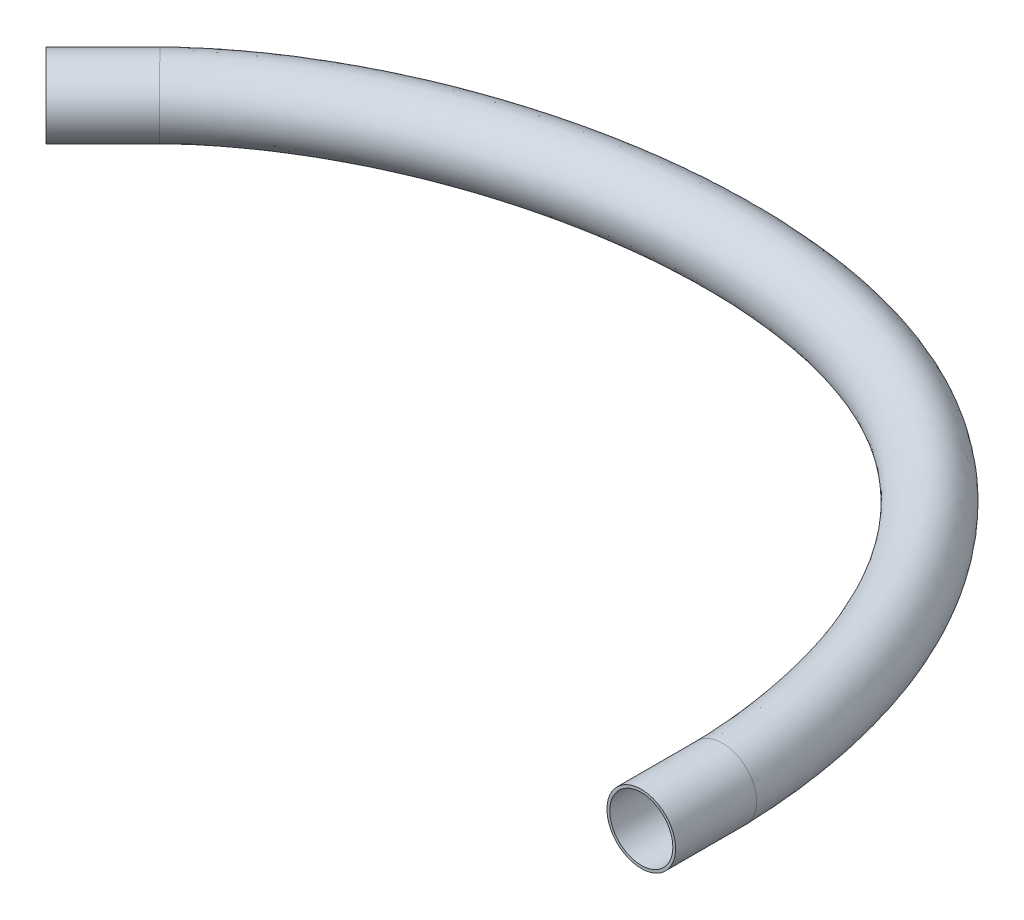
ISO-10303-21;
HEADER;
FILE_DESCRIPTION(('STEP AP214'),'2;1');
FILE_NAME('part.step','',(''),(''),'','','');
FILE_SCHEMA(('AUTOMOTIVE_DESIGN { 1 0 10303 214 1 1 1 1 }'));
ENDSEC;
DATA;
#1=APPLICATION_CONTEXT('core data for automotive mechanical design processes');
#2=APPLICATION_PROTOCOL_DEFINITION('international standard','automotive_design',2000,#1);
#3=PRODUCT_CONTEXT('',#1,'mechanical');
#4=PRODUCT('Part','Part','',(#3));
#5=PRODUCT_RELATED_PRODUCT_CATEGORY('part','',(#4));
#6=PRODUCT_DEFINITION_FORMATION('','',#4);
#7=PRODUCT_DEFINITION_CONTEXT('part definition',#1,'design');
#8=PRODUCT_DEFINITION('design','',#6,#7);
#9=PRODUCT_DEFINITION_SHAPE('','',#8);
#10=(LENGTH_UNIT() NAMED_UNIT(*) SI_UNIT(.MILLI.,.METRE.));
#11=(NAMED_UNIT(*) PLANE_ANGLE_UNIT() SI_UNIT($,.RADIAN.));
#12=(NAMED_UNIT(*) SI_UNIT($,.STERADIAN.) SOLID_ANGLE_UNIT());
#13=UNCERTAINTY_MEASURE_WITH_UNIT(LENGTH_MEASURE(1.E-05),#10,'distance_accuracy_value','');
#14=(GEOMETRIC_REPRESENTATION_CONTEXT(3) GLOBAL_UNCERTAINTY_ASSIGNED_CONTEXT((#13)) GLOBAL_UNIT_ASSIGNED_CONTEXT((#10,
#11,#12)) REPRESENTATION_CONTEXT('',''));
#15=CARTESIAN_POINT('',(0.,0.,0.));
#16=DIRECTION('',(0.,0.,1.));
#17=DIRECTION('',(1.,0.,0.));
#18=AXIS2_PLACEMENT_3D('',#15,#16,#17);
#19=CARTESIAN_POINT('',(-554.764913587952,0.,-250.235086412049));
#20=DIRECTION('',(-0.707106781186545,0.,0.70710678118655));
#21=DIRECTION('',(0.70710678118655,0.,0.707106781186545));
#22=AXIS2_PLACEMENT_3D('',#19,#20,#21);
#23=CYLINDRICAL_SURFACE('',#22,21.75);
#24=CARTESIAN_POINT('',(-554.999999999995,21.75,-250.000000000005));
#25=CARTESIAN_POINT('',(-555.049383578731,21.7500006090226,-250.05035269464));
#26=CARTESIAN_POINT('',(-555.098770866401,21.7496574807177,-250.100709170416));
#27=CARTESIAN_POINT('',(-555.575503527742,21.7430293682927,-250.586797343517));
#28=CARTESIAN_POINT('',(-556.00290408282,21.711367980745,-251.022585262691));
#29=CARTESIAN_POINT('',(-556.641378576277,21.6254809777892,-251.673589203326));
#30=CARTESIAN_POINT('',(-556.853848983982,21.5904314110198,-251.890229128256));
#31=CARTESIAN_POINT('',(-557.277623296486,21.5075808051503,-252.322319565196));
#32=CARTESIAN_POINT('',(-557.488926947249,21.4597770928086,-252.537769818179));
#33=CARTESIAN_POINT('',(-558.121388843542,21.2971088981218,-253.18264305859));
#34=CARTESIAN_POINT('',(-558.540204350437,21.1631076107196,-253.60967730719));
#35=CARTESIAN_POINT('',(-559.368431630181,20.8451069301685,-254.454157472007));
#36=CARTESIAN_POINT('',(-559.777843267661,20.6611068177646,-254.871603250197));
#37=CARTESIAN_POINT('',(-560.382437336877,20.3487657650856,-255.488061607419));
#38=CARTESIAN_POINT('',(-560.582310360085,20.2386420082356,-255.691856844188));
#39=CARTESIAN_POINT('',(-560.97857512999,20.0064881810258,-256.095897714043));
#40=CARTESIAN_POINT('',(-561.1749677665,19.8844612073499,-256.296144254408));
#41=CARTESIAN_POINT('',(-561.758527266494,19.5007568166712,-256.891155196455));
#42=CARTESIAN_POINT('',(-562.140096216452,19.2214453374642,-257.280211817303));
#43=CARTESIAN_POINT('',(-562.885095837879,18.6181287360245,-258.039830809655));
#44=CARTESIAN_POINT('',(-563.248538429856,18.2941535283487,-258.410405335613));
#45=CARTESIAN_POINT('',(-563.955037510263,17.6036345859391,-259.130768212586));
#46=CARTESIAN_POINT('',(-564.298094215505,17.2370913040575,-259.480556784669));
#47=CARTESIAN_POINT('',(-564.96145062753,16.4639539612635,-260.156930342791));
#48=CARTESIAN_POINT('',(-565.281744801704,16.057350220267,-260.483509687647));
#49=CARTESIAN_POINT('',(-565.897213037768,15.207052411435,-261.111055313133));
#50=CARTESIAN_POINT('',(-566.192387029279,14.7633582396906,-261.412021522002));
#51=CARTESIAN_POINT('',(-566.755550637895,13.8419750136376,-261.986236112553));
#52=CARTESIAN_POINT('',(-567.02353670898,13.3642815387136,-262.259480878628));
#53=CARTESIAN_POINT('',(-567.530374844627,12.3783475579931,-262.776264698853));
#54=CARTESIAN_POINT('',(-567.769226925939,11.8701070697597,-263.01980377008));
#55=CARTESIAN_POINT('',(-568.216075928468,10.8267450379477,-263.475421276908));
#56=CARTESIAN_POINT('',(-568.424075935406,10.2916261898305,-263.687502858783));
#57=CARTESIAN_POINT('',(-568.80777018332,9.19826495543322,-264.078726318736));
#58=CARTESIAN_POINT('',(-568.983464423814,8.64002256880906,-264.257868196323));
#59=CARTESIAN_POINT('',(-569.301294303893,7.50439510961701,-264.581934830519));
#60=CARTESIAN_POINT('',(-569.443430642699,6.92701043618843,-264.72686030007));
#61=CARTESIAN_POINT('',(-569.693138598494,5.75719240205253,-264.981468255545));
#62=CARTESIAN_POINT('',(-569.800710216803,5.16475904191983,-265.091150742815));
#63=CARTESIAN_POINT('',(-569.980520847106,3.96907471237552,-265.274489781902));
#64=CARTESIAN_POINT('',(-570.052760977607,3.36582408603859,-265.348147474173));
#65=CARTESIAN_POINT('',(-570.161399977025,2.15277583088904,-265.458918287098));
#66=CARTESIAN_POINT('',(-570.197798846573,1.54297820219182,-265.496031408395));
#67=CARTESIAN_POINT('',(-570.23449648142,0.321170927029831,-265.533449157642));
#68=CARTESIAN_POINT('',(-570.234795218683,-0.29083872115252,-265.533753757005));
#69=CARTESIAN_POINT('',(-570.199290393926,-1.51271834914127,-265.497552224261));
#70=CARTESIAN_POINT('',(-570.163486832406,-2.12258832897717,-265.461046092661));
#71=CARTESIAN_POINT('',(-570.056033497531,-3.3358361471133,-265.351484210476));
#72=CARTESIAN_POINT('',(-569.984384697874,-3.93921416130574,-265.278429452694));
#73=CARTESIAN_POINT('',(-569.805750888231,-5.13520534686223,-265.096290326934));
#74=CARTESIAN_POINT('',(-569.698765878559,-5.72781851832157,-264.987205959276));
#75=CARTESIAN_POINT('',(-569.450218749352,-6.8980749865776,-264.733781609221));
#76=CARTESIAN_POINT('',(-569.308656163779,-7.47571808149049,-264.58944115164));
#77=CARTESIAN_POINT('',(-568.991961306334,-8.61191956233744,-264.266531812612));
#78=CARTESIAN_POINT('',(-568.816829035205,-9.17047794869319,-264.087962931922));
#79=CARTESIAN_POINT('',(-568.434230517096,-10.2645668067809,-263.697856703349));
#80=CARTESIAN_POINT('',(-568.226762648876,-10.8000961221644,-263.486317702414));
#81=CARTESIAN_POINT('',(-567.780974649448,-11.8442899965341,-263.03178201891));
#82=CARTESIAN_POINT('',(-567.54265450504,-12.3529545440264,-262.788785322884));
#83=CARTESIAN_POINT('',(-567.036879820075,-13.3397570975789,-262.273085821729));
#84=CARTESIAN_POINT('',(-566.769427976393,-13.8178979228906,-262.000385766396));
#85=CARTESIAN_POINT('',(-566.207275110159,-14.7403041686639,-261.42720175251));
#86=CARTESIAN_POINT('',(-565.912574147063,-15.1845696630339,-261.126717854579));
#87=CARTESIAN_POINT('',(-565.29804823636,-16.0360235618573,-260.500133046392));
#88=CARTESIAN_POINT('',(-564.978226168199,-16.4432162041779,-260.174035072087));
#89=CARTESIAN_POINT('',(-564.315715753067,-17.2176794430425,-259.498524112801));
#90=CARTESIAN_POINT('',(-563.973027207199,-17.584949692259,-259.149110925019));
#91=CARTESIAN_POINT('',(-563.266982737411,-18.2771732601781,-258.429211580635));
#92=CARTESIAN_POINT('',(-562.903616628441,-18.6021054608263,-258.058715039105));
#93=CARTESIAN_POINT('',(-562.345288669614,-19.0557509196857,-257.489430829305));
#94=CARTESIAN_POINT('',(-562.156960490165,-19.2013443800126,-257.297407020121));
#95=CARTESIAN_POINT('',(-561.776124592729,-19.4811030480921,-256.909097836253));
#96=CARTESIAN_POINT('',(-561.583615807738,-19.6152652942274,-256.712811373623));
#97=CARTESIAN_POINT('',(-561.000148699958,-20.0003372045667,-256.117894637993));
#98=CARTESIAN_POINT('',(-560.603429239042,-20.2336861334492,-255.713390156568));
#99=CARTESIAN_POINT('',(-559.797625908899,-20.6517559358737,-254.891774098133));
#100=CARTESIAN_POINT('',(-559.388542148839,-20.8364772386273,-254.474662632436));
#101=CARTESIAN_POINT('',(-558.768274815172,-21.0759597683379,-253.842223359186));
#102=CARTESIAN_POINT('',(-558.560569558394,-21.1494798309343,-253.630442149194));
#103=CARTESIAN_POINT('',(-558.143229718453,-21.2839463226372,-253.204912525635));
#104=CARTESIAN_POINT('',(-557.933595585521,-21.3448956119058,-252.991164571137));
#105=CARTESIAN_POINT('',(-557.302444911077,-21.5086838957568,-252.34762828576));
#106=CARTESIAN_POINT('',(-556.878404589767,-21.5925696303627,-251.915266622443));
#107=CARTESIAN_POINT('',(-556.235893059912,-21.6805067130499,-251.260146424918));
#108=CARTESIAN_POINT('',(-556.018582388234,-21.7035350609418,-251.03857123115));
#109=CARTESIAN_POINT('',(-555.583574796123,-21.7362502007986,-250.59502699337));
#110=CARTESIAN_POINT('',(-555.365878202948,-21.7459453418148,-250.373058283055));
#111=CARTESIAN_POINT('',(-555.098772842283,-21.7496571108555,-250.100711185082));
#112=CARTESIAN_POINT('',(-555.049385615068,-21.7500002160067,-250.050354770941));
#113=CARTESIAN_POINT('',(-554.999999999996,-21.75,-250.000000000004));
#114=B_SPLINE_CURVE_WITH_KNOTS('',3,(#24,#25,#26,#27,#28,#29,#30,#31,#32,#33,#34,#35,#36,#37,
#38,#39,#40,#41,#42,#43,#44,#45,#46,#47,#48,#49,#50,#51,#52,#53,#54,#55,#56,#57,#58,#59,#60,#61,
#62,#63,#64,#65,#66,#67,#68,#69,#70,#71,#72,#73,#74,#75,#76,#77,#78,#79,#80,#81,#82,#83,#84,#85,
#86,#87,#88,#89,#90,#91,#92,#93,#94,#95,#96,#97,#98,#99,#100,#101,#102,#103,#104,#105,#106,#107,
#108,#109,#110,#111,#112,#113),.UNSPECIFIED.,.F.,.F.,(4,2,2,2,2,2,2,2,2,2,2,2,2,2,2,2,2,2,2,2,2,
2,2,2,2,2,2,2,2,2,2,2,2,2,2,2,2,2,2,2,2,2,2,2,4),(0.,0.211596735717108,2.04250028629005,
2.95867520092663,3.87504229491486,5.71160982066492,7.54820376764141,8.46583220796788,
9.38322255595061,11.2179101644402,13.0513748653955,14.8848200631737,16.7187093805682,
18.5526038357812,20.3867371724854,22.220869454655,24.05481816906,25.8887669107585,
27.7226774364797,29.5565878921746,31.3904402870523,33.2242926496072,35.058146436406,
36.8920001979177,38.7258041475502,40.5596080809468,42.3934367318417,44.2272653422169,
46.0611859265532,47.8951072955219,49.7288590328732,51.5626067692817,53.3961446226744,
55.2296984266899,57.0641633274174,57.9814496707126,58.8989729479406,60.7349019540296,
62.5708147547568,63.487404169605,64.4037848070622,66.2353270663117,67.1687397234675,
68.1015676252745,68.313164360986),.UNSPECIFIED.);
#115=CARTESIAN_POINT('',(-554.999999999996,-21.75,-250.000000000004));
#116=VERTEX_POINT('',#115);
#117=CARTESIAN_POINT('',(-554.999999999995,21.75,-250.000000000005));
#118=VERTEX_POINT('',#117);
#119=EDGE_CURVE('E78',#116,#118,#114,.F.);
#120=ORIENTED_EDGE('',*,*,#119,.F.);
#121=CARTESIAN_POINT('',(-554.999999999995,21.75,-250.000000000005));
#122=CARTESIAN_POINT('',(-554.950616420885,21.7500006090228,-249.949647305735));
#123=CARTESIAN_POINT('',(-554.901229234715,21.7496574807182,-249.899290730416));
#124=CARTESIAN_POINT('',(-554.424497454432,21.7430293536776,-249.413199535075));
#125=CARTESIAN_POINT('',(-553.997105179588,21.7113678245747,-248.97740133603));
#126=CARTESIAN_POINT('',(-553.358654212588,21.6254804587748,-248.326371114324));
#127=CARTESIAN_POINT('',(-553.146193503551,21.5904307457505,-248.109720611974));
#128=CARTESIAN_POINT('',(-552.722442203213,21.5075798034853,-247.677605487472));
#129=CARTESIAN_POINT('',(-552.511151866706,21.4597759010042,-247.462141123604));
#130=CARTESIAN_POINT('',(-551.878735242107,21.2971070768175,-246.81722032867));
#131=CARTESIAN_POINT('',(-551.459956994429,21.1631052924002,-246.390147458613));
#132=CARTESIAN_POINT('',(-550.631817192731,20.8451035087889,-245.545577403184));
#133=CARTESIAN_POINT('',(-550.222455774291,20.6611027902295,-245.128080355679));
#134=CARTESIAN_POINT('',(-549.617945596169,20.3487607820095,-244.511536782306));
#135=CARTESIAN_POINT('',(-549.418101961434,20.2386367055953,-244.307711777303));
#136=CARTESIAN_POINT('',(-549.021898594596,20.0064822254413,-243.903608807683));
#137=CARTESIAN_POINT('',(-548.825537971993,19.8844549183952,-243.703329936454));
#138=CARTESIAN_POINT('',(-548.242078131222,19.5007495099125,-243.108218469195));
#139=CARTESIAN_POINT('',(-547.860580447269,19.2214373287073,-242.719090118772));
#140=CARTESIAN_POINT('',(-547.115730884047,18.6181192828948,-241.959320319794));
#141=CARTESIAN_POINT('',(-546.752367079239,18.2941433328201,-241.588666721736));
#142=CARTESIAN_POINT('',(-546.046030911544,17.603622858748,-240.868140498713));
#143=CARTESIAN_POINT('',(-545.703058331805,17.2370787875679,-240.518267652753));
#144=CARTESIAN_POINT('',(-545.039872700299,16.4639392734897,-239.84172220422));
#145=CARTESIAN_POINT('',(-544.719665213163,16.0573340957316,-239.515055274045));
#146=CARTESIAN_POINT('',(-544.104370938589,15.2070332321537,-238.887334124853));
#147=CARTESIAN_POINT('',(-543.809284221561,14.7633374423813,-238.586279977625));
#148=CARTESIAN_POINT('',(-543.246293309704,13.8419507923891,-238.011891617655));
#149=CARTESIAN_POINT('',(-542.978392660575,13.364255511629,-237.738561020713));
#150=CARTESIAN_POINT('',(-542.471721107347,12.378317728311,-237.221610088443));
#151=CARTESIAN_POINT('',(-542.232950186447,11.8700752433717,-236.977989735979));
#152=CARTESIAN_POINT('',(-541.786257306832,10.826709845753,-236.522216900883));
#153=CARTESIAN_POINT('',(-541.57833221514,10.2915896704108,-236.310061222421));
#154=CARTESIAN_POINT('',(-541.194779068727,9.19822568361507,-235.9186984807));
#155=CARTESIAN_POINT('',(-541.019151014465,8.63998187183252,-235.739491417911));
#156=CARTESIAN_POINT('',(-540.701442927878,7.50435149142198,-235.415305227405));
#157=CARTESIAN_POINT('',(-540.559362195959,6.92696532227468,-235.270325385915));
#158=CARTESIAN_POINT('',(-540.309753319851,5.75714424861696,-235.015621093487));
#159=CARTESIAN_POINT('',(-540.202225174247,5.16470934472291,-234.905896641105));
#160=CARTESIAN_POINT('',(-540.022488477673,3.96902414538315,-234.722487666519));
#161=CARTESIAN_POINT('',(-539.950278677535,3.365774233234,-234.64880186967));
#162=CARTESIAN_POINT('',(-539.841685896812,2.15272749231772,-234.537989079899));
#163=CARTESIAN_POINT('',(-539.805302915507,1.5429306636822,-234.500862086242));
#164=CARTESIAN_POINT('',(-539.768622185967,0.321125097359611,-234.463431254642));
#165=CARTESIAN_POINT('',(-539.768324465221,-0.290883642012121,-234.46312744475));
#166=CARTESIAN_POINT('',(-539.803816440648,-1.51276133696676,-234.499345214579));
#167=CARTESIAN_POINT('',(-539.83960613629,-2.12263029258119,-234.535866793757));
#168=CARTESIAN_POINT('',(-539.94701714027,-3.3358745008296,-234.645473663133));
#169=CARTESIAN_POINT('',(-540.018637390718,-3.93924994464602,-234.718557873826));
#170=CARTESIAN_POINT('',(-540.197200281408,-5.13523591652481,-234.900769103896));
#171=CARTESIAN_POINT('',(-540.304142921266,-5.72784644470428,-235.009896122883));
#172=CARTESIAN_POINT('',(-540.552592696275,-6.89809759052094,-235.263417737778));
#173=CARTESIAN_POINT('',(-540.694100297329,-7.47573800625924,-235.407812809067));
#174=CARTESIAN_POINT('',(-541.01067412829,-8.61193414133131,-235.730841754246));
#175=CARTESIAN_POINT('',(-541.18574035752,-9.17048986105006,-235.909475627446));
#176=CARTESIAN_POINT('',(-541.568197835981,-10.2645741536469,-236.299720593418));
#177=CARTESIAN_POINT('',(-541.775590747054,-10.8001015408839,-236.511333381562));
#178=CARTESIAN_POINT('',(-542.221221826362,-11.8442916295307,-236.9660231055));
#179=CARTESIAN_POINT('',(-542.459460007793,-12.3529543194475,-237.209100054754));
#180=CARTESIAN_POINT('',(-542.965066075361,-13.3397533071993,-237.724964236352));
#181=CARTESIAN_POINT('',(-543.232431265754,-13.817892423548,-237.99774871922));
#182=CARTESIAN_POINT('',(-543.79440855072,-14.7402954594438,-238.571103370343));
#183=CARTESIAN_POINT('',(-544.089020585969,-15.1845594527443,-238.871673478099));
#184=CARTESIAN_POINT('',(-544.703370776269,-16.0360132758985,-239.498431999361));
#185=CARTESIAN_POINT('',(-545.023106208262,-16.4432071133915,-239.824617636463));
#186=CARTESIAN_POINT('',(-545.68544632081,-17.217672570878,-240.500301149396));
#187=CARTESIAN_POINT('',(-546.0280512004,-17.5849438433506,-240.849799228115));
#188=CARTESIAN_POINT('',(-546.733933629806,-18.2771693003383,-241.569863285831));
#189=CARTESIAN_POINT('',(-547.097221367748,-18.6021023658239,-241.940439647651));
#190=CARTESIAN_POINT('',(-547.655437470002,-19.0557489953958,-242.509838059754));
#191=CARTESIAN_POINT('',(-547.843729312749,-19.2013428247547,-242.701899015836));
#192=CARTESIAN_POINT('',(-548.224494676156,-19.4811021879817,-243.090280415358));
#193=CARTESIAN_POINT('',(-548.416969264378,-19.6152647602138,-243.286601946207));
#194=CARTESIAN_POINT('',(-549.000337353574,-20.0003375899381,-243.881620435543));
#195=CARTESIAN_POINT('',(-549.396995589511,-20.2336870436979,-244.286188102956));
#196=CARTESIAN_POINT('',(-550.20268789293,-20.6517576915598,-245.107919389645));
#197=CARTESIAN_POINT('',(-550.611721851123,-20.8364793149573,-245.525082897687));
#198=CARTESIAN_POINT('',(-551.231924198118,-21.0759621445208,-246.157590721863));
#199=CARTESIAN_POINT('',(-551.439609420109,-21.1494822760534,-246.369393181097));
#200=CARTESIAN_POINT('',(-551.856912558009,-21.2839488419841,-246.794962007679));
#201=CARTESIAN_POINT('',(-552.06653002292,-21.3448981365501,-247.008727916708));
#202=CARTESIAN_POINT('',(-552.697635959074,-21.5086863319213,-247.652312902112));
#203=CARTESIAN_POINT('',(-553.121653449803,-21.5925718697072,-248.08470018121));
#204=CARTESIAN_POINT('',(-553.764138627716,-21.6805079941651,-248.739844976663));
#205=CARTESIAN_POINT('',(-553.981440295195,-21.7035358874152,-248.96142451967));
#206=CARTESIAN_POINT('',(-554.41643376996,-21.7362504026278,-249.404973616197));
#207=CARTESIAN_POINT('',(-554.634125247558,-21.7459453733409,-249.626942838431));
#208=CARTESIAN_POINT('',(-554.90122725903,-21.7496571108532,-249.899288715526));
#209=CARTESIAN_POINT('',(-554.950614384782,-21.7500002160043,-249.949645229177));
#210=CARTESIAN_POINT('',(-554.999999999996,-21.75,-250.000000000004));
#211=B_SPLINE_CURVE_WITH_KNOTS('',3,(#121,#122,#123,#124,#125,#126,#127,#128,#129,#130,#131,
#132,#133,#134,#135,#136,#137,#138,#139,#140,#141,#142,#143,#144,#145,#146,#147,#148,#149,#150,
#151,#152,#153,#154,#155,#156,#157,#158,#159,#160,#161,#162,#163,#164,#165,#166,#167,#168,#169,
#170,#171,#172,#173,#174,#175,#176,#177,#178,#179,#180,#181,#182,#183,#184,#185,#186,#187,#188,
#189,#190,#191,#192,#193,#194,#195,#196,#197,#198,#199,#200,#201,#202,#203,#204,#205,#206,#207,
#208,#209,#210),.UNSPECIFIED.,.F.,.F.,(4,2,2,2,2,2,2,2,2,2,2,2,2,2,2,2,2,2,2,2,2,2,2,2,2,2,2,2,
2,2,2,2,2,2,2,2,2,2,2,2,2,2,2,2,4),(0.,0.211596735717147,2.04250490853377,2.9586821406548,
3.87505155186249,5.7116237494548,7.54822237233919,8.46585305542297,9.38324564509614,
11.2179377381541,13.0514069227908,14.8848566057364,16.7187529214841,18.5526543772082,
20.3867947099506,22.2209339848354,24.0548868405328,25.8888397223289,27.7227543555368,
29.5566689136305,31.390518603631,33.2243682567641,35.0582193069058,36.8920703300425,
38.7258672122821,40.559664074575,42.3934856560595,44.2273072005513,46.0612230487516,
47.8951396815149,49.7288867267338,51.5626297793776,53.3961743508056,55.2297348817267,
57.0642065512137,57.9814962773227,58.8990229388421,60.7349587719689,62.5708783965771,
63.4874711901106,64.403855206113,66.2354042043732,67.1688071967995,68.1016254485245,
68.3132221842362),.UNSPECIFIED.);
#212=EDGE_CURVE('E38',#116,#118,#211,.F.);
#213=ORIENTED_EDGE('',*,*,#212,.T.);
#214=EDGE_LOOP('',(#120,#213));
#215=FACE_BOUND('',#214,.T.);
#216=CARTESIAN_POINT('',(-591.062445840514,0.,-213.937554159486));
#217=DIRECTION('',(0.707106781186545,0.,-0.70710678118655));
#218=DIRECTION('',(-0.70710678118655,0.,-0.707106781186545));
#219=AXIS2_PLACEMENT_3D('',#216,#217,#218);
#220=CIRCLE('',#219,21.75);
#221=CARTESIAN_POINT('',(-606.442018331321,0.,-229.317126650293));
#222=VERTEX_POINT('',#221);
#223=EDGE_CURVE('E53',#222,#222,#220,.T.);
#224=ORIENTED_EDGE('',*,*,#223,.T.);
#225=EDGE_LOOP('',(#224));
#226=FACE_BOUND('',#225,.T.);
#227=ADVANCED_FACE('F35',(#215,#226),#23,.T.);
#228=CARTESIAN_POINT('',(21.754454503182,0.,-51.2214302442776));
#229=CARTESIAN_POINT('',(21.749062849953,0.,-51.3855983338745));
#230=CARTESIAN_POINT('',(21.7438174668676,0.,-51.5453159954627));
#231=CARTESIAN_POINT('',(21.7220672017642,0.,-52.2075673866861));
#232=CARTESIAN_POINT('',(21.7040976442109,0.,-52.7269556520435));
#233=CARTESIAN_POINT('',(21.6672117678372,0.,-53.739064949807));
#234=CARTESIAN_POINT('',(21.6478678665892,0.,-54.244814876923));
#235=CARTESIAN_POINT('',(21.5871365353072,0.,-55.7611435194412));
#236=CARTESIAN_POINT('',(21.5430494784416,0.,-56.7708010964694));
#237=CARTESIAN_POINT('',(21.4000158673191,0.,-59.7960334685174));
#238=CARTESIAN_POINT('',(21.2902968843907,0.,-61.8078679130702));
#239=CARTESIAN_POINT('',(20.9182583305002,0.,-67.8279631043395));
#240=CARTESIAN_POINT('',(20.613057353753,0.,-71.8208158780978));
#241=CARTESIAN_POINT('',(19.5275866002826,0.,-83.7341628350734));
#242=CARTESIAN_POINT('',(18.5774523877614,0.,-91.5894495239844));
#243=CARTESIAN_POINT('',(15.0607345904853,0.,-114.865725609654));
#244=CARTESIAN_POINT('',(11.8278856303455,0.,-129.997239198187));
#245=CARTESIAN_POINT('',(-0.432497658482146,0.,-174.000814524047));
#246=CARTESIAN_POINT('',(-12.0223721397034,0.,-201.485473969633));
#247=CARTESIAN_POINT('',(-41.4902896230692,0.,-251.449290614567));
#248=CARTESIAN_POINT('',(-59.3734660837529,0.,-273.929165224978));
#249=CARTESIAN_POINT('',(-100.811578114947,0.,-312.454865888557));
#250=CARTESIAN_POINT('',(-124.37123482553,0.,-328.493733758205));
#251=CARTESIAN_POINT('',(-183.609148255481,0.,-356.054346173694));
#252=CARTESIAN_POINT('',(-220.283914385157,0.,-364.830740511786));
#253=CARTESIAN_POINT('',(-295.738265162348,0.,-371.198313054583));
#254=CARTESIAN_POINT('',(-334.553059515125,0.,-368.791378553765));
#255=CARTESIAN_POINT('',(-410.159846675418,0.,-354.440073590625));
#256=CARTESIAN_POINT('',(-446.957825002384,0.,-342.493995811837));
#257=CARTESIAN_POINT('',(-497.47490873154,0.,-318.288518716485));
#258=CARTESIAN_POINT('',(-513.533663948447,0.,-309.168687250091));
#259=CARTESIAN_POINT('',(-536.037476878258,0.,-293.980577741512));
#260=CARTESIAN_POINT('',(-543.274495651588,0.,-288.666147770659));
#261=CARTESIAN_POINT('',(-553.67876532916,0.,-280.322583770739));
#262=CARTESIAN_POINT('',(-557.071616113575,0.,-277.479389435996));
#263=CARTESIAN_POINT('',(-562.040846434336,0.,-273.122147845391));
#264=CARTESIAN_POINT('',(-563.677246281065,0.,-271.65432475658));
#265=CARTESIAN_POINT('',(-566.100906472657,0.,-269.429539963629));
#266=CARTESIAN_POINT('',(-566.903636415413,0.,-268.68410330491));
#267=CARTESIAN_POINT('',(-568.099878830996,0.,-267.560193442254));
#268=CARTESIAN_POINT('',(-568.497317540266,0.,-267.184597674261));
#269=CARTESIAN_POINT('',(-569.289557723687,0.,-266.431489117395));
#270=CARTESIAN_POINT('',(-569.699780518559,0.,-266.039142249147));
#271=CARTESIAN_POINT('',(-570.161098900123,0.,-265.595413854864));
#272=CARTESIAN_POINT('',(-570.237572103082,0.,-265.521856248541));
#273=CARTESIAN_POINT('',(-570.317442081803,0.,-265.445031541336));
#274=CARTESIAN_POINT('',(21.754454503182,43.5,-51.2214302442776));
#275=CARTESIAN_POINT('',(21.749062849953,43.5,-51.3855983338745));
#276=CARTESIAN_POINT('',(21.7438174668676,43.5,-51.5453159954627));
#277=CARTESIAN_POINT('',(21.7220672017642,43.5,-52.2075673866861));
#278=CARTESIAN_POINT('',(21.7040976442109,43.5,-52.7269556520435));
#279=CARTESIAN_POINT('',(21.6672117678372,43.5,-53.739064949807));
#280=CARTESIAN_POINT('',(21.6478678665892,43.5,-54.244814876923));
#281=CARTESIAN_POINT('',(21.5871365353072,43.5,-55.7611435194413));
#282=CARTESIAN_POINT('',(21.5430494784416,43.5,-56.7708010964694));
#283=CARTESIAN_POINT('',(21.4000158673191,43.5,-59.7960334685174));
#284=CARTESIAN_POINT('',(21.2902968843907,43.5,-61.8078679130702));
#285=CARTESIAN_POINT('',(20.9182583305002,43.5,-67.8279631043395));
#286=CARTESIAN_POINT('',(20.613057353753,43.5,-71.8208158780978));
#287=CARTESIAN_POINT('',(19.5275866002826,43.5,-83.7341628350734));
#288=CARTESIAN_POINT('',(18.5774523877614,43.5,-91.5894495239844));
#289=CARTESIAN_POINT('',(15.0607345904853,43.5,-114.865725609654));
#290=CARTESIAN_POINT('',(11.8278856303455,43.5,-129.997239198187));
#291=CARTESIAN_POINT('',(-0.432497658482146,43.5,-174.000814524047));
#292=CARTESIAN_POINT('',(-12.0223721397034,43.5,-201.485473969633));
#293=CARTESIAN_POINT('',(-41.4902896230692,43.5,-251.449290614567));
#294=CARTESIAN_POINT('',(-59.3734660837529,43.5,-273.929165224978));
#295=CARTESIAN_POINT('',(-100.811578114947,43.5,-312.454865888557));
#296=CARTESIAN_POINT('',(-124.37123482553,43.5,-328.493733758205));
#297=CARTESIAN_POINT('',(-183.609148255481,43.5,-356.054346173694));
#298=CARTESIAN_POINT('',(-220.283914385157,43.5,-364.830740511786));
#299=CARTESIAN_POINT('',(-295.738265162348,43.5,-371.198313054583));
#300=CARTESIAN_POINT('',(-334.553059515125,43.5,-368.791378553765));
#301=CARTESIAN_POINT('',(-410.159846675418,43.5,-354.440073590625));
#302=CARTESIAN_POINT('',(-446.957825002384,43.5,-342.493995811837));
#303=CARTESIAN_POINT('',(-497.47490873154,43.5,-318.288518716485));
#304=CARTESIAN_POINT('',(-513.533663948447,43.5,-309.168687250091));
#305=CARTESIAN_POINT('',(-536.037476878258,43.5,-293.980577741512));
#306=CARTESIAN_POINT('',(-543.274495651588,43.5,-288.666147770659));
#307=CARTESIAN_POINT('',(-553.67876532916,43.5,-280.322583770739));
#308=CARTESIAN_POINT('',(-557.071616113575,43.5,-277.479389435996));
#309=CARTESIAN_POINT('',(-562.040846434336,43.5,-273.122147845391));
#310=CARTESIAN_POINT('',(-563.677246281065,43.5,-271.65432475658));
#311=CARTESIAN_POINT('',(-566.100906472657,43.5,-269.429539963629));
#312=CARTESIAN_POINT('',(-566.903636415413,43.5,-268.68410330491));
#313=CARTESIAN_POINT('',(-568.099878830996,43.5,-267.560193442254));
#314=CARTESIAN_POINT('',(-568.497317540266,43.5,-267.184597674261));
#315=CARTESIAN_POINT('',(-569.289557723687,43.5,-266.431489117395));
#316=CARTESIAN_POINT('',(-569.699780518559,43.5,-266.039142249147));
#317=CARTESIAN_POINT('',(-570.161098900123,43.5,-265.595413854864));
#318=CARTESIAN_POINT('',(-570.237572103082,43.5,-265.521856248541));
#319=CARTESIAN_POINT('',(-570.317442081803,43.5,-265.445031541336));
#320=CARTESIAN_POINT('',(-21.7221045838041,43.5,-49.7935612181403));
#321=CARTESIAN_POINT('',(-21.7274962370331,43.5,-49.9577293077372));
#322=CARTESIAN_POINT('',(-21.7330339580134,43.5,-50.1263478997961));
#323=CARTESIAN_POINT('',(-21.7536360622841,43.5,-50.7536407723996));
#324=CARTESIAN_POINT('',(-21.7689436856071,43.5,-51.1948322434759));
#325=CARTESIAN_POINT('',(-21.8020274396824,43.5,-52.1026153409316));
#326=CARTESIAN_POINT('',(-21.8193753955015,43.5,-52.5561782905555));
#327=CARTESIAN_POINT('',(-21.8738333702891,43.5,-53.9158749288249));
#328=CARTESIAN_POINT('',(-21.9133574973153,43.5,-54.8210164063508));
#329=CARTESIAN_POINT('',(-22.0415532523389,43.5,-57.5324207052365));
#330=CARTESIAN_POINT('',(-22.1398482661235,43.5,-59.3346633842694));
#331=CARTESIAN_POINT('',(-22.4729619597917,43.5,-64.724900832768));
#332=CARTESIAN_POINT('',(-22.7460094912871,43.5,-68.2964048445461));
#333=CARTESIAN_POINT('',(-23.7159412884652,43.5,-78.941679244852));
#334=CARTESIAN_POINT('',(-24.5636181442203,43.5,-85.9462081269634));
#335=CARTESIAN_POINT('',(-27.6926896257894,43.5,-106.656750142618));
#336=CARTESIAN_POINT('',(-30.5601749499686,43.5,-120.059610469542));
#337=CARTESIAN_POINT('',(-41.3680425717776,43.5,-158.849981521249));
#338=CARTESIAN_POINT('',(-51.5133327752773,43.5,-182.815719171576));
#339=CARTESIAN_POINT('',(-76.9367995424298,43.5,-225.922037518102));
#340=CARTESIAN_POINT('',(-92.2098426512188,43.5,-245.061900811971));
#341=CARTESIAN_POINT('',(-127.213618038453,43.5,-277.605491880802));
#342=CARTESIAN_POINT('',(-146.939629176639,43.5,-291.016177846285));
#343=CARTESIAN_POINT('',(-196.551585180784,43.5,-314.098285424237));
#344=CARTESIAN_POINT('',(-228.281851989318,43.5,-321.851063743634));
#345=CARTESIAN_POINT('',(-295.05623001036,43.5,-327.486135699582));
#346=CARTESIAN_POINT('',(-330.065131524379,43.5,-325.366542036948));
#347=CARTESIAN_POINT('',(-398.423557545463,43.5,-312.391084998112));
#348=CARTESIAN_POINT('',(-431.767096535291,43.5,-301.536928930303));
#349=CARTESIAN_POINT('',(-476.875023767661,43.5,-279.923272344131));
#350=CARTESIAN_POINT('',(-491.093394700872,43.5,-271.833595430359));
#351=CARTESIAN_POINT('',(-510.75525085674,43.5,-258.56355868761));
#352=CARTESIAN_POINT('',(-517.03178508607,43.5,-253.951292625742));
#353=CARTESIAN_POINT('',(-525.978689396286,43.5,-246.776443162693));
#354=CARTESIAN_POINT('',(-528.883037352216,43.5,-244.3421047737));
#355=CARTESIAN_POINT('',(-533.116484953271,43.5,-240.630030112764));
#356=CARTESIAN_POINT('',(-534.507124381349,43.5,-239.382578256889));
#357=CARTESIAN_POINT('',(-536.561576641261,43.5,-237.496705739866));
#358=CARTESIAN_POINT('',(-537.241143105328,43.5,-236.865632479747));
#359=CARTESIAN_POINT('',(-538.252525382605,43.5,-235.915404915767));
#360=CARTESIAN_POINT('',(-538.588324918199,43.5,-235.59805945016));
#361=CARTESIAN_POINT('',(-539.257253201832,43.5,-234.962171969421));
#362=CARTESIAN_POINT('',(-539.574959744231,43.5,-234.658463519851));
#363=CARTESIAN_POINT('',(-539.998641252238,43.5,-234.250936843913));
#364=CARTESIAN_POINT('',(-540.081907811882,43.5,-234.170844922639));
#365=CARTESIAN_POINT('',(-540.161777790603,43.5,-234.09402021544));
#366=CARTESIAN_POINT('',(-21.7221045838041,0.,-49.7935612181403));
#367=CARTESIAN_POINT('',(-21.7274962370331,0.,-49.9577293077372));
#368=CARTESIAN_POINT('',(-21.7330339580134,0.,-50.1263478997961));
#369=CARTESIAN_POINT('',(-21.7536360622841,0.,-50.7536407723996));
#370=CARTESIAN_POINT('',(-21.7689436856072,0.,-51.1948322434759));
#371=CARTESIAN_POINT('',(-21.8020274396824,0.,-52.1026153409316));
#372=CARTESIAN_POINT('',(-21.8193753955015,0.,-52.5561782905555));
#373=CARTESIAN_POINT('',(-21.8738333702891,0.,-53.9158749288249));
#374=CARTESIAN_POINT('',(-21.9133574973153,0.,-54.8210164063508));
#375=CARTESIAN_POINT('',(-22.0415532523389,0.,-57.5324207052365));
#376=CARTESIAN_POINT('',(-22.1398482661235,0.,-59.3346633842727));
#377=CARTESIAN_POINT('',(-22.4729619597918,0.,-64.7249008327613));
#378=CARTESIAN_POINT('',(-22.7460094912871,0.,-68.2964048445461));
#379=CARTESIAN_POINT('',(-23.7159412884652,0.,-78.941679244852));
#380=CARTESIAN_POINT('',(-24.5636181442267,0.,-85.9462081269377));
#381=CARTESIAN_POINT('',(-27.6926896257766,0.,-106.65675014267));
#382=CARTESIAN_POINT('',(-30.5601749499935,0.,-120.059610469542));
#383=CARTESIAN_POINT('',(-41.3680425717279,0.,-158.849981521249));
#384=CARTESIAN_POINT('',(-51.5133327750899,0.,-182.815719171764));
#385=CARTESIAN_POINT('',(-76.9367995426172,0.,-225.922037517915));
#386=CARTESIAN_POINT('',(-92.2098426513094,0.,-245.061900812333));
#387=CARTESIAN_POINT('',(-127.213618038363,0.,-277.60549188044));
#388=CARTESIAN_POINT('',(-146.939629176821,0.,-291.016177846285));
#389=CARTESIAN_POINT('',(-196.55158518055,0.,-314.098285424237));
#390=CARTESIAN_POINT('',(-228.281851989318,0.,-321.851063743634));
#391=CARTESIAN_POINT('',(-295.05623001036,0.,-327.486135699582));
#392=CARTESIAN_POINT('',(-330.065131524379,0.,-325.366542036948));
#393=CARTESIAN_POINT('',(-398.423557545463,0.,-312.391084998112));
#394=CARTESIAN_POINT('',(-431.767096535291,0.,-301.536928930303));
#395=CARTESIAN_POINT('',(-476.875023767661,0.,-279.923272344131));
#396=CARTESIAN_POINT('',(-491.093394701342,0.,-271.833595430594));
#397=CARTESIAN_POINT('',(-510.755250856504,0.,-258.563558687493));
#398=CARTESIAN_POINT('',(-517.03178508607,0.,-253.951292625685));
#399=CARTESIAN_POINT('',(-525.978689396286,0.,-246.776443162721));
#400=CARTESIAN_POINT('',(-528.883037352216,0.,-244.3421047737));
#401=CARTESIAN_POINT('',(-533.116484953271,0.,-240.630030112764));
#402=CARTESIAN_POINT('',(-534.507124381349,0.,-239.382578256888));
#403=CARTESIAN_POINT('',(-536.561576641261,0.,-237.496705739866));
#404=CARTESIAN_POINT('',(-537.241143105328,0.,-236.86563247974));
#405=CARTESIAN_POINT('',(-538.252525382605,0.,-235.915404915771));
#406=CARTESIAN_POINT('',(-538.588324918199,0.,-235.59805945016));
#407=CARTESIAN_POINT('',(-539.257253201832,0.,-234.962171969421));
#408=CARTESIAN_POINT('',(-539.574959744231,0.,-234.658463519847));
#409=CARTESIAN_POINT('',(-539.998641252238,0.,-234.250936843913));
#410=CARTESIAN_POINT('',(-540.081907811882,0.,-234.170844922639));
#411=CARTESIAN_POINT('',(-540.161777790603,0.,-234.09402021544));
#412=CARTESIAN_POINT('',(-21.7221045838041,-43.5,-49.7935612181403));
#413=CARTESIAN_POINT('',(-21.7274962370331,-43.5,-49.9577293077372));
#414=CARTESIAN_POINT('',(-21.7330339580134,-43.5,-50.1263478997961));
#415=CARTESIAN_POINT('',(-21.7536360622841,-43.5,-50.7536407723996));
#416=CARTESIAN_POINT('',(-21.7689436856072,-43.5,-51.1948322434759));
#417=CARTESIAN_POINT('',(-21.8020274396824,-43.5,-52.1026153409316));
#418=CARTESIAN_POINT('',(-21.8193753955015,-43.5,-52.5561782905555));
#419=CARTESIAN_POINT('',(-21.8738333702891,-43.5,-53.9158749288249));
#420=CARTESIAN_POINT('',(-21.9133574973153,-43.5,-54.8210164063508));
#421=CARTESIAN_POINT('',(-22.0415532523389,-43.5,-57.5324207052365));
#422=CARTESIAN_POINT('',(-22.1398482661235,-43.5,-59.334663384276));
#423=CARTESIAN_POINT('',(-22.4729619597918,-43.5,-64.7249008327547));
#424=CARTESIAN_POINT('',(-22.7460094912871,-43.5,-68.2964048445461));
#425=CARTESIAN_POINT('',(-23.7159412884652,-43.5,-78.941679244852));
#426=CARTESIAN_POINT('',(-24.5636181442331,-43.5,-85.946208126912));
#427=CARTESIAN_POINT('',(-27.6926896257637,-43.5,-106.656750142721));
#428=CARTESIAN_POINT('',(-30.5601749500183,-43.5,-120.059610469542));
#429=CARTESIAN_POINT('',(-41.3680425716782,-43.5,-158.849981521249));
#430=CARTESIAN_POINT('',(-51.5133327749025,-43.5,-182.815719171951));
#431=CARTESIAN_POINT('',(-76.9367995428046,-43.5,-225.922037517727));
#432=CARTESIAN_POINT('',(-92.2098426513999,-43.5,-245.061900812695));
#433=CARTESIAN_POINT('',(-127.213618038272,-43.5,-277.605491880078));
#434=CARTESIAN_POINT('',(-146.939629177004,-43.5,-291.016177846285));
#435=CARTESIAN_POINT('',(-196.551585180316,-43.5,-314.098285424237));
#436=CARTESIAN_POINT('',(-228.281851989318,-43.5,-321.851063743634));
#437=CARTESIAN_POINT('',(-295.05623001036,-43.5,-327.486135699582));
#438=CARTESIAN_POINT('',(-330.065131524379,-43.5,-325.366542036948));
#439=CARTESIAN_POINT('',(-398.423557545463,-43.5,-312.391084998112));
#440=CARTESIAN_POINT('',(-431.767096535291,-43.5,-301.536928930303));
#441=CARTESIAN_POINT('',(-476.875023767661,-43.5,-279.923272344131));
#442=CARTESIAN_POINT('',(-491.093394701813,-43.5,-271.833595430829));
#443=CARTESIAN_POINT('',(-510.755250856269,-43.5,-258.563558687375));
#444=CARTESIAN_POINT('',(-517.03178508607,-43.5,-253.951292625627));
#445=CARTESIAN_POINT('',(-525.978689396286,-43.5,-246.77644316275));
#446=CARTESIAN_POINT('',(-528.883037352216,-43.5,-244.3421047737));
#447=CARTESIAN_POINT('',(-533.116484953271,-43.5,-240.630030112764));
#448=CARTESIAN_POINT('',(-534.507124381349,-43.5,-239.382578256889));
#449=CARTESIAN_POINT('',(-536.561576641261,-43.5,-237.496705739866));
#450=CARTESIAN_POINT('',(-537.241143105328,-43.5,-236.865632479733));
#451=CARTESIAN_POINT('',(-538.252525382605,-43.5,-235.915404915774));
#452=CARTESIAN_POINT('',(-538.588324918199,-43.5,-235.59805945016));
#453=CARTESIAN_POINT('',(-539.257253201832,-43.5,-234.962171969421));
#454=CARTESIAN_POINT('',(-539.574959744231,-43.5,-234.658463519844));
#455=CARTESIAN_POINT('',(-539.998641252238,-43.5,-234.250936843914));
#456=CARTESIAN_POINT('',(-540.081907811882,-43.5,-234.170844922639));
#457=CARTESIAN_POINT('',(-540.161777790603,-43.5,-234.09402021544));
#458=CARTESIAN_POINT('',(21.754454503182,-43.5,-51.2214302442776));
#459=CARTESIAN_POINT('',(21.749062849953,-43.5,-51.3855983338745));
#460=CARTESIAN_POINT('',(21.7438174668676,-43.5,-51.5453159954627));
#461=CARTESIAN_POINT('',(21.7220672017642,-43.5,-52.2075673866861));
#462=CARTESIAN_POINT('',(21.7040976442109,-43.5,-52.7269556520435));
#463=CARTESIAN_POINT('',(21.6672117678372,-43.5,-53.739064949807));
#464=CARTESIAN_POINT('',(21.6478678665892,-43.5,-54.244814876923));
#465=CARTESIAN_POINT('',(21.5871365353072,-43.5,-55.7611435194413));
#466=CARTESIAN_POINT('',(21.5430494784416,-43.5,-56.7708010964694));
#467=CARTESIAN_POINT('',(21.4000158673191,-43.5,-59.7960334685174));
#468=CARTESIAN_POINT('',(21.2902968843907,-43.5,-61.8078679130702));
#469=CARTESIAN_POINT('',(20.9182583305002,-43.5,-67.8279631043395));
#470=CARTESIAN_POINT('',(20.613057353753,-43.5,-71.8208158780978));
#471=CARTESIAN_POINT('',(19.5275866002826,-43.5,-83.7341628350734));
#472=CARTESIAN_POINT('',(18.5774523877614,-43.5,-91.5894495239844));
#473=CARTESIAN_POINT('',(15.0607345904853,-43.5,-114.865725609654));
#474=CARTESIAN_POINT('',(11.8278856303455,-43.5,-129.997239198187));
#475=CARTESIAN_POINT('',(-0.432497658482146,-43.5,-174.000814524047));
#476=CARTESIAN_POINT('',(-12.0223721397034,-43.5,-201.485473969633));
#477=CARTESIAN_POINT('',(-41.4902896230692,-43.5,-251.449290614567));
#478=CARTESIAN_POINT('',(-59.3734660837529,-43.5,-273.929165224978));
#479=CARTESIAN_POINT('',(-100.811578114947,-43.5,-312.454865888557));
#480=CARTESIAN_POINT('',(-124.37123482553,-43.5,-328.493733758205));
#481=CARTESIAN_POINT('',(-183.609148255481,-43.5,-356.054346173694));
#482=CARTESIAN_POINT('',(-220.283914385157,-43.5,-364.830740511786));
#483=CARTESIAN_POINT('',(-295.738265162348,-43.5,-371.198313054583));
#484=CARTESIAN_POINT('',(-334.553059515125,-43.5,-368.791378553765));
#485=CARTESIAN_POINT('',(-410.159846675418,-43.5,-354.440073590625));
#486=CARTESIAN_POINT('',(-446.957825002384,-43.5,-342.493995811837));
#487=CARTESIAN_POINT('',(-497.47490873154,-43.5,-318.288518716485));
#488=CARTESIAN_POINT('',(-513.533663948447,-43.5,-309.168687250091));
#489=CARTESIAN_POINT('',(-536.037476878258,-43.5,-293.980577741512));
#490=CARTESIAN_POINT('',(-543.274495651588,-43.5,-288.666147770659));
#491=CARTESIAN_POINT('',(-553.67876532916,-43.5,-280.322583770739));
#492=CARTESIAN_POINT('',(-557.071616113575,-43.5,-277.479389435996));
#493=CARTESIAN_POINT('',(-562.040846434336,-43.5,-273.122147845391));
#494=CARTESIAN_POINT('',(-563.677246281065,-43.5,-271.65432475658));
#495=CARTESIAN_POINT('',(-566.100906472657,-43.5,-269.429539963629));
#496=CARTESIAN_POINT('',(-566.903636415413,-43.5,-268.68410330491));
#497=CARTESIAN_POINT('',(-568.099878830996,-43.5,-267.560193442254));
#498=CARTESIAN_POINT('',(-568.497317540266,-43.5,-267.184597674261));
#499=CARTESIAN_POINT('',(-569.289557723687,-43.5,-266.431489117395));
#500=CARTESIAN_POINT('',(-569.699780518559,-43.5,-266.039142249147));
#501=CARTESIAN_POINT('',(-570.161098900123,-43.5,-265.595413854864));
#502=CARTESIAN_POINT('',(-570.237572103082,-43.5,-265.521856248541));
#503=CARTESIAN_POINT('',(-570.317442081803,-43.5,-265.445031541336));
#504=CARTESIAN_POINT('',(21.754454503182,0.,-51.2214302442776));
#505=CARTESIAN_POINT('',(21.749062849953,0.,-51.3855983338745));
#506=CARTESIAN_POINT('',(21.7438174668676,0.,-51.5453159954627));
#507=CARTESIAN_POINT('',(21.7220672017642,0.,-52.2075673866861));
#508=CARTESIAN_POINT('',(21.7040976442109,0.,-52.7269556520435));
#509=CARTESIAN_POINT('',(21.6672117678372,0.,-53.739064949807));
#510=CARTESIAN_POINT('',(21.6478678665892,0.,-54.244814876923));
#511=CARTESIAN_POINT('',(21.5871365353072,0.,-55.7611435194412));
#512=CARTESIAN_POINT('',(21.5430494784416,0.,-56.7708010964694));
#513=CARTESIAN_POINT('',(21.4000158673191,0.,-59.7960334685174));
#514=CARTESIAN_POINT('',(21.2902968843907,0.,-61.8078679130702));
#515=CARTESIAN_POINT('',(20.9182583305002,0.,-67.8279631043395));
#516=CARTESIAN_POINT('',(20.613057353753,0.,-71.8208158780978));
#517=CARTESIAN_POINT('',(19.5275866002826,0.,-83.7341628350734));
#518=CARTESIAN_POINT('',(18.5774523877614,0.,-91.5894495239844));
#519=CARTESIAN_POINT('',(15.0607345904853,0.,-114.865725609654));
#520=CARTESIAN_POINT('',(11.8278856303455,0.,-129.997239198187));
#521=CARTESIAN_POINT('',(-0.432497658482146,0.,-174.000814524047));
#522=CARTESIAN_POINT('',(-12.0223721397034,0.,-201.485473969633));
#523=CARTESIAN_POINT('',(-41.4902896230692,0.,-251.449290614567));
#524=CARTESIAN_POINT('',(-59.3734660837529,0.,-273.929165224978));
#525=CARTESIAN_POINT('',(-100.811578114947,0.,-312.454865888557));
#526=CARTESIAN_POINT('',(-124.37123482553,0.,-328.493733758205));
#527=CARTESIAN_POINT('',(-183.609148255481,0.,-356.054346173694));
#528=CARTESIAN_POINT('',(-220.283914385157,0.,-364.830740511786));
#529=CARTESIAN_POINT('',(-295.738265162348,0.,-371.198313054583));
#530=CARTESIAN_POINT('',(-334.553059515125,0.,-368.791378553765));
#531=CARTESIAN_POINT('',(-410.159846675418,0.,-354.440073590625));
#532=CARTESIAN_POINT('',(-446.957825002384,0.,-342.493995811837));
#533=CARTESIAN_POINT('',(-497.47490873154,0.,-318.288518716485));
#534=CARTESIAN_POINT('',(-513.533663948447,0.,-309.168687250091));
#535=CARTESIAN_POINT('',(-536.037476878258,0.,-293.980577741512));
#536=CARTESIAN_POINT('',(-543.274495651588,0.,-288.666147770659));
#537=CARTESIAN_POINT('',(-553.67876532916,0.,-280.322583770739));
#538=CARTESIAN_POINT('',(-557.071616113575,0.,-277.479389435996));
#539=CARTESIAN_POINT('',(-562.040846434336,0.,-273.122147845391));
#540=CARTESIAN_POINT('',(-563.677246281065,0.,-271.65432475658));
#541=CARTESIAN_POINT('',(-566.100906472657,0.,-269.429539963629));
#542=CARTESIAN_POINT('',(-566.903636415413,0.,-268.68410330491));
#543=CARTESIAN_POINT('',(-568.099878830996,0.,-267.560193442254));
#544=CARTESIAN_POINT('',(-568.497317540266,0.,-267.184597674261));
#545=CARTESIAN_POINT('',(-569.289557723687,0.,-266.431489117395));
#546=CARTESIAN_POINT('',(-569.699780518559,0.,-266.039142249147));
#547=CARTESIAN_POINT('',(-570.161098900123,0.,-265.595413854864));
#548=CARTESIAN_POINT('',(-570.237572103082,0.,-265.521856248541));
#549=CARTESIAN_POINT('',(-570.317442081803,0.,-265.445031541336));
#550=(BOUNDED_SURFACE() B_SPLINE_SURFACE(3,3,((#228,#229,#230,#231,#232,#233,#234,#235,#236,
#237,#238,#239,#240,#241,#242,#243,#244,#245,#246,#247,#248,#249,#250,#251,#252,#253,#254,#255,
#256,#257,#258,#259,#260,#261,#262,#263,#264,#265,#266,#267,#268,#269,#270,#271,#272,#273),
(#274,#275,#276,#277,#278,#279,#280,#281,#282,#283,#284,#285,#286,#287,#288,#289,#290,#291,#292,
#293,#294,#295,#296,#297,#298,#299,#300,#301,#302,#303,#304,#305,#306,#307,#308,#309,#310,#311,
#312,#313,#314,#315,#316,#317,#318,#319),(#320,#321,#322,#323,#324,#325,#326,#327,#328,#329,
#330,#331,#332,#333,#334,#335,#336,#337,#338,#339,#340,#341,#342,#343,#344,#345,#346,#347,#348,
#349,#350,#351,#352,#353,#354,#355,#356,#357,#358,#359,#360,#361,#362,#363,#364,#365),(#366,
#367,#368,#369,#370,#371,#372,#373,#374,#375,#376,#377,#378,#379,#380,#381,#382,#383,#384,#385,
#386,#387,#388,#389,#390,#391,#392,#393,#394,#395,#396,#397,#398,#399,#400,#401,#402,#403,#404,
#405,#406,#407,#408,#409,#410,#411),(#412,#413,#414,#415,#416,#417,#418,#419,#420,#421,#422,
#423,#424,#425,#426,#427,#428,#429,#430,#431,#432,#433,#434,#435,#436,#437,#438,#439,#440,#441,
#442,#443,#444,#445,#446,#447,#448,#449,#450,#451,#452,#453,#454,#455,#456,#457),(#458,#459,
#460,#461,#462,#463,#464,#465,#466,#467,#468,#469,#470,#471,#472,#473,#474,#475,#476,#477,#478,
#479,#480,#481,#482,#483,#484,#485,#486,#487,#488,#489,#490,#491,#492,#493,#494,#495,#496,#497,
#498,#499,#500,#501,#502,#503),(#504,#505,#506,#507,#508,#509,#510,#511,#512,#513,#514,#515,
#516,#517,#518,#519,#520,#521,#522,#523,#524,#525,#526,#527,#528,#529,#530,#531,#532,#533,#534,
#535,#536,#537,#538,#539,#540,#541,#542,#543,#544,#545,#546,#547,#548,#549)),.UNSPECIFIED.,.T.,
.F.,.F.) B_SPLINE_SURFACE_WITH_KNOTS((4,3,4),(4,2,2,2,2,2,2,2,2,2,2,2,2,2,2,2,2,2,2,2,2,2,4),
(0.,0.5,1.),(-0.000584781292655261,0.,0.0017119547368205,0.003423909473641,0.00684781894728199,
0.013695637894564,0.027391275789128,0.0547825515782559,0.109565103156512,0.219130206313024,
0.328695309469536,0.438260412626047,0.578695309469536,0.719130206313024,0.859565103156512,
0.929782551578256,0.964891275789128,0.982445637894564,0.991222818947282,0.995611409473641,
0.997805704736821,1.,1.00048329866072),
.UNSPECIFIED.) GEOMETRIC_REPRESENTATION_ITEM() RATIONAL_B_SPLINE_SURFACE(((1.,1.,1.,1.,1.,1.,1.,
1.,1.,1.,1.,1.,1.,1.,1.,1.,1.,1.,1.,1.,1.,1.,1.,1.,1.,1.,1.,1.,1.,1.,1.,1.,1.,1.,1.,1.,1.,1.,1.,
1.,1.,1.,1.,1.,1.,1.),(0.333333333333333,0.333333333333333,0.333333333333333,0.333333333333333,
0.333333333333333,0.333333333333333,0.333333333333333,0.333333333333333,0.333333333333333,
0.333333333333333,0.333333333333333,0.333333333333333,0.333333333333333,0.333333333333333,
0.333333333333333,0.333333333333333,0.333333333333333,0.333333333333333,0.333333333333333,
0.333333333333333,0.333333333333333,0.333333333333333,0.333333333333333,0.333333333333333,
0.333333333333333,0.333333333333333,0.333333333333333,0.333333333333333,0.333333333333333,
0.333333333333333,0.333333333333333,0.333333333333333,0.333333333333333,0.333333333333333,
0.333333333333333,0.333333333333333,0.333333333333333,0.333333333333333,0.333333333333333,
0.333333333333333,0.333333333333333,0.333333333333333,0.333333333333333,0.333333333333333,
0.333333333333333,0.333333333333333),(0.333333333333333,0.333333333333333,0.333333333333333,
0.333333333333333,0.333333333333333,0.333333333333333,0.333333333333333,0.333333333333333,
0.333333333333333,0.333333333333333,0.333333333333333,0.333333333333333,0.333333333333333,
0.333333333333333,0.333333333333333,0.333333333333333,0.333333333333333,0.333333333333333,
0.333333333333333,0.333333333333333,0.333333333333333,0.333333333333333,0.333333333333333,
0.333333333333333,0.333333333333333,0.333333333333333,0.333333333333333,0.333333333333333,
0.333333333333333,0.333333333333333,0.333333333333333,0.333333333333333,0.333333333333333,
0.333333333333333,0.333333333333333,0.333333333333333,0.333333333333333,0.333333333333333,
0.333333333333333,0.333333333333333,0.333333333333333,0.333333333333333,0.333333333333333,
0.333333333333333,0.333333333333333,0.333333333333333),(1.,1.,1.,1.,1.,1.,1.,1.,1.,1.,1.,1.,1.,
1.,1.,1.,1.,1.,1.,1.,1.,1.,1.,1.,1.,1.,1.,1.,1.,1.,1.,1.,1.,1.,1.,1.,1.,1.,1.,1.,1.,1.,1.,1.,1.,
1.),(0.333333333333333,0.333333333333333,0.333333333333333,0.333333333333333,0.333333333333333,
0.333333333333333,0.333333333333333,0.333333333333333,0.333333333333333,0.333333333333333,
0.333333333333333,0.333333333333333,0.333333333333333,0.333333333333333,0.333333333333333,
0.333333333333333,0.333333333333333,0.333333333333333,0.333333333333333,0.333333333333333,
0.333333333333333,0.333333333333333,0.333333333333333,0.333333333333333,0.333333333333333,
0.333333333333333,0.333333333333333,0.333333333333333,0.333333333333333,0.333333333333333,
0.333333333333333,0.333333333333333,0.333333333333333,0.333333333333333,0.333333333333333,
0.333333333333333,0.333333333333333,0.333333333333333,0.333333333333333,0.333333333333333,
0.333333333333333,0.333333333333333,0.333333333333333,0.333333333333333,0.333333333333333,
0.333333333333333),(0.333333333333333,0.333333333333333,0.333333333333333,0.333333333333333,
0.333333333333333,0.333333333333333,0.333333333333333,0.333333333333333,0.333333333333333,
0.333333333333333,0.333333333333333,0.333333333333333,0.333333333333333,0.333333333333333,
0.333333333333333,0.333333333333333,0.333333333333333,0.333333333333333,0.333333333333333,
0.333333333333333,0.333333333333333,0.333333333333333,0.333333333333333,0.333333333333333,
0.333333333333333,0.333333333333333,0.333333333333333,0.333333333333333,0.333333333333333,
0.333333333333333,0.333333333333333,0.333333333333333,0.333333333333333,0.333333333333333,
0.333333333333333,0.333333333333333,0.333333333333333,0.333333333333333,0.333333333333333,
0.333333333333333,0.333333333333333,0.333333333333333,0.333333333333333,0.333333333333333,
0.333333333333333,0.333333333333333),(1.,1.,1.,1.,1.,1.,1.,1.,1.,1.,1.,1.,1.,1.,1.,1.,1.,1.,1.,
1.,1.,1.,1.,1.,1.,1.,1.,1.,1.,1.,1.,1.,1.,1.,1.,1.,1.,1.,1.,1.,1.,1.,1.,1.,1.,1.))) REPRESENTATION_ITEM('') SURFACE());
#551=CARTESIAN_POINT('',(0.,-21.75,-50.9999999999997));
#552=CARTESIAN_POINT('',(-0.0542570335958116,-21.75000035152,-50.9991092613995));
#553=CARTESIAN_POINT('',(-0.108517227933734,-21.7497972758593,-50.9982183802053));
#554=CARTESIAN_POINT('',(-0.773094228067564,-21.7448197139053,-50.9873057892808));
#555=CARTESIAN_POINT('',(-1.38356401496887,-21.7145248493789,-50.9772702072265));
#556=CARTESIAN_POINT('',(-2.29560060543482,-21.630676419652,-50.9622602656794));
#557=CARTESIAN_POINT('',(-2.59912309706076,-21.5963043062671,-50.9572621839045));
#558=CARTESIAN_POINT('',(-3.20453072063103,-21.5148033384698,-50.9472874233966));
#559=CARTESIAN_POINT('',(-3.50641550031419,-21.467671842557,-50.9423107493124));
#560=CARTESIAN_POINT('',(-4.41006001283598,-21.3070104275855,-50.9274056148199));
#561=CARTESIAN_POINT('',(-5.00851646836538,-21.1743325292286,-50.9175233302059));
#562=CARTESIAN_POINT('',(-6.19211149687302,-20.8589392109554,-50.8979576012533));
#563=CARTESIAN_POINT('',(-6.77724986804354,-20.6762230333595,-50.888274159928));
#564=CARTESIAN_POINT('',(-7.6414337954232,-20.3657714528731,-50.8739578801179));
#565=CARTESIAN_POINT('',(-7.92713787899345,-20.2562719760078,-50.869222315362));
#566=CARTESIAN_POINT('',(-8.49360067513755,-20.0253534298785,-50.8598283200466));
#567=CARTESIAN_POINT('',(-8.77436065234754,-19.9039374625,-50.855169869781));
#568=CARTESIAN_POINT('',(-9.60865637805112,-19.5220444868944,-50.8413199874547));
#569=CARTESIAN_POINT('',(-10.1542365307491,-19.2439121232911,-50.8322535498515));
#570=CARTESIAN_POINT('',(-11.2195855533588,-18.6428893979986,-50.8145326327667));
#571=CARTESIAN_POINT('',(-11.739371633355,-18.3200294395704,-50.8058778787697));
#572=CARTESIAN_POINT('',(-12.7499222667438,-17.6316671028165,-50.7890363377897));
#573=CARTESIAN_POINT('',(-13.2406871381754,-17.266165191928,-50.7808495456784));
#574=CARTESIAN_POINT('',(-14.1897869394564,-16.4950417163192,-50.7650034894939));
#575=CARTESIAN_POINT('',(-14.6481150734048,-16.089411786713,-50.7573443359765));
#576=CARTESIAN_POINT('',(-15.5289769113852,-15.2409747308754,-50.7426126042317));
#577=CARTESIAN_POINT('',(-15.9515105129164,-14.7981674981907,-50.735540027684));
#578=CARTESIAN_POINT('',(-16.7578278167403,-13.8784638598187,-50.7220337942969));
#579=CARTESIAN_POINT('',(-17.1416063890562,-13.4015629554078,-50.7156002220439));
#580=CARTESIAN_POINT('',(-17.8676192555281,-12.4171147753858,-50.703421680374));
#581=CARTESIAN_POINT('',(-18.2098535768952,-11.9095675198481,-50.697676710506));
#582=CARTESIAN_POINT('',(-18.8502824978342,-10.8675331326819,-50.6869199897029));
#583=CARTESIAN_POINT('',(-19.1484853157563,-10.3330510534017,-50.6819081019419));
#584=CARTESIAN_POINT('',(-19.6988058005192,-9.24085946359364,-50.6726544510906));
#585=CARTESIAN_POINT('',(-19.9509234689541,-8.68314995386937,-50.6684126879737));
#586=CARTESIAN_POINT('',(-20.4072745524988,-7.54848127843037,-50.6607318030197));
#587=CARTESIAN_POINT('',(-20.6115090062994,-6.97152253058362,-50.6572926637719));
#588=CARTESIAN_POINT('',(-20.9706472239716,-5.80244643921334,-50.6512432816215));
#589=CARTESIAN_POINT('',(-21.125550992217,-5.21032909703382,-50.6486330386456));
#590=CARTESIAN_POINT('',(-21.3849103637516,-4.01521561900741,-50.6442617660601));
#591=CARTESIAN_POINT('',(-21.4893717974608,-3.41222074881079,-50.642500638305));
#592=CARTESIAN_POINT('',(-21.647129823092,-2.19957289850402,-50.6398407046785));
#593=CARTESIAN_POINT('',(-21.7004264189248,-1.5899199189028,-50.6389418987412));
#594=CARTESIAN_POINT('',(-21.7554755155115,-0.368290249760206,-50.6380135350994));
#595=CARTESIAN_POINT('',(-21.7572279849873,0.243686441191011,-50.6379839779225));
#596=CARTESIAN_POINT('',(-21.7091762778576,1.46561179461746,-50.638794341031));
#597=CARTESIAN_POINT('',(-21.6593721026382,2.07556045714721,-50.639634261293));
#598=CARTESIAN_POINT('',(-21.5085667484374,3.28905093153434,-50.642177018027));
#599=CARTESIAN_POINT('',(-21.407569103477,3.89259318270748,-50.6438797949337));
#600=CARTESIAN_POINT('',(-21.1550972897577,5.08902301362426,-50.6481351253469));
#601=CARTESIAN_POINT('',(-21.003623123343,5.68191059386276,-50.650687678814));
#602=CARTESIAN_POINT('',(-20.6512736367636,6.85282418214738,-50.6566229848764));
#603=CARTESIAN_POINT('',(-20.4503976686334,7.43084999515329,-50.6600057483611));
#604=CARTESIAN_POINT('',(-20.0006746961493,8.56792322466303,-50.6675755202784));
#605=CARTESIAN_POINT('',(-19.751827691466,9.12697064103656,-50.6717625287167));
#606=CARTESIAN_POINT('',(-19.2079136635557,10.2221521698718,-50.6809091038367));
#607=CARTESIAN_POINT('',(-18.9128433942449,10.758284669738,-50.685868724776));
#608=CARTESIAN_POINT('',(-18.2785944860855,11.8037841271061,-50.6965225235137));
#609=CARTESIAN_POINT('',(-17.9394158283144,12.3131510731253,-50.7022167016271));
#610=CARTESIAN_POINT('',(-17.2193948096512,13.3014548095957,-50.7142958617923));
#611=CARTESIAN_POINT('',(-16.8385562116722,13.7803943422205,-50.7206807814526));
#612=CARTESIAN_POINT('',(-16.0379008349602,14.7044888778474,-50.734093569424));
#613=CARTESIAN_POINT('',(-15.6180841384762,15.1496439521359,-50.7411214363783));
#614=CARTESIAN_POINT('',(-14.7424871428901,16.0029757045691,-50.755766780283));
#615=CARTESIAN_POINT('',(-14.2867098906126,16.4111555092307,-50.7633842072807));
#616=CARTESIAN_POINT('',(-13.3424203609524,17.1876712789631,-50.7791518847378));
#617=CARTESIAN_POINT('',(-12.8539078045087,17.5560069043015,-50.7873021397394));
#618=CARTESIAN_POINT('',(-11.8472869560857,18.2504307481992,-50.8040803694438));
#619=CARTESIAN_POINT('',(-11.3291643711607,18.5764983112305,-50.8127085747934));
#620=CARTESIAN_POINT('',(-10.5329474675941,19.0318966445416,-50.8259545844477));
#621=CARTESIAN_POINT('',(-10.2643613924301,19.1780827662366,-50.8304206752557));
#622=CARTESIAN_POINT('',(-9.72119678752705,19.4590426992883,-50.8394479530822));
#623=CARTESIAN_POINT('',(-9.44661672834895,19.5938135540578,-50.8440091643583));
#624=CARTESIAN_POINT('',(-8.61423194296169,19.9807922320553,-50.8578292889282));
#625=CARTESIAN_POINT('',(-8.0481580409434,20.2154514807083,-50.8672184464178));
#626=CARTESIAN_POINT('',(-6.89824122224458,20.6361720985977,-50.8862710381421));
#627=CARTESIAN_POINT('',(-6.31439845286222,20.8222338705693,-50.8959344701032));
#628=CARTESIAN_POINT('',(-5.42905261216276,21.063744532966,-50.9105721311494));
#629=CARTESIAN_POINT('',(-5.13255928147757,21.1379441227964,-50.915471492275));
#630=CARTESIAN_POINT('',(-4.53678870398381,21.273772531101,-50.9253108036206));
#631=CARTESIAN_POINT('',(-4.23751211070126,21.3354042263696,-50.9302507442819));
#632=CARTESIAN_POINT('',(-3.33642471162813,21.5012428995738,-50.9451160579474));
#633=CARTESIAN_POINT('',(-2.73096867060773,21.5864991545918,-50.955093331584));
#634=CARTESIAN_POINT('',(-1.79733079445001,21.678087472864,-50.9704612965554));
#635=CARTESIAN_POINT('',(-1.47079118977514,21.7026850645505,-50.9758329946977));
#636=CARTESIAN_POINT('',(-0.817098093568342,21.7371073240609,-50.9865799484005));
#637=CARTESIAN_POINT('',(-0.489945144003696,21.7469416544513,-50.9919551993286));
#638=CARTESIAN_POINT('',(-0.10851885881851,21.7497970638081,-50.9982183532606));
#639=CARTESIAN_POINT('',(-0.0542587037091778,21.7500001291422,-50.9991092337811));
#640=CARTESIAN_POINT('',(4.780690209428E-12,21.75,-51.));
#641=B_SPLINE_CURVE_WITH_KNOTS('',3,(#551,#552,#553,#554,#555,#556,#557,#558,#559,#560,#561,
#562,#563,#564,#565,#566,#567,#568,#569,#570,#571,#572,#573,#574,#575,#576,#577,#578,#579,#580,
#581,#582,#583,#584,#585,#586,#587,#588,#589,#590,#591,#592,#593,#594,#595,#596,#597,#598,#599,
#600,#601,#602,#603,#604,#605,#606,#607,#608,#609,#610,#611,#612,#613,#614,#615,#616,#617,#618,
#619,#620,#621,#622,#623,#624,#625,#626,#627,#628,#629,#630,#631,#632,#633,#634,#635,#636,#637,
#638,#639,#640),.UNSPECIFIED.,.F.,.F.,(4,2,2,2,2,2,2,2,2,2,2,2,2,2,2,2,2,2,2,2,2,2,2,2,2,2,2,2,
2,2,2,2,2,2,2,2,2,2,2,2,2,2,2,2,4),(0.,0.162801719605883,1.99394508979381,2.91025600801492,
3.82675676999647,5.66364279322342,7.50055663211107,8.41833415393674,9.33587340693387,
11.1708609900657,13.0046073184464,14.8383335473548,16.6724428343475,18.5065573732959,
20.3409143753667,22.1752701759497,24.0092831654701,25.8432960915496,27.6772692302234,
29.5112422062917,31.3450031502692,33.1787639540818,35.0125258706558,36.8462877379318,
38.6799230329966,40.513558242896,42.3472175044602,44.1808767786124,46.0146648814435,
47.8484537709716,49.6820771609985,51.5156966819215,53.3491610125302,55.1826409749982,
57.0170135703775,57.934254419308,58.851732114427,60.6879808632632,62.5242143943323,
63.4409998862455,64.3575752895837,66.189524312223,67.1718019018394,68.1534363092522,
68.3162380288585),.UNSPECIFIED.);
#642=CARTESIAN_POINT('',(0.,-21.75,-50.9999999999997));
#643=VERTEX_POINT('',#642);
#644=CARTESIAN_POINT('',(4.780690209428E-12,21.75,-51.));
#645=VERTEX_POINT('',#644);
#646=EDGE_CURVE('E86',#643,#645,#641,.T.);
#647=CARTESIAN_POINT('',(0.,-21.75,-50.9999999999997));
#648=CARTESIAN_POINT('',(0.0542570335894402,-21.7500003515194,-51.0008907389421));
#649=CARTESIAN_POINT('',(0.108517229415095,-21.7497972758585,-51.001781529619));
#650=CARTESIAN_POINT('',(0.773091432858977,-21.7448197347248,-51.0126918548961));
#651=CARTESIAN_POINT('',(1.38355860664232,-21.714525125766,-51.0227138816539));
#652=CARTESIAN_POINT('',(2.29559159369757,-21.6306773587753,-51.037686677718));
#653=CARTESIAN_POINT('',(2.5991129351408,-21.5963055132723,-51.042669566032));
#654=CARTESIAN_POINT('',(3.20451836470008,-21.5148051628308,-51.0526084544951));
#655=CARTESIAN_POINT('',(3.50640210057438,-21.4676740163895,-51.0575644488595));
#656=CARTESIAN_POINT('',(4.41004362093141,-21.3070137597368,-51.072399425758));
#657=CARTESIAN_POINT('',(5.00849828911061,-21.1743367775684,-51.0822241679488));
#658=CARTESIAN_POINT('',(6.19209015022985,-20.8589454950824,-51.1016549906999));
#659=CARTESIAN_POINT('',(6.77722714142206,-20.6762304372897,-51.1112610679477));
#660=CARTESIAN_POINT('',(7.64140932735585,-20.3657806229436,-51.1254481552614));
#661=CARTESIAN_POINT('',(7.92711291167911,-20.2562817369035,-51.1301384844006));
#662=CARTESIAN_POINT('',(8.49357479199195,-20.025364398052,-51.1394379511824));
#663=CARTESIAN_POINT('',(8.77433435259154,-19.9039490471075,-51.1440471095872));
#664=CARTESIAN_POINT('',(9.60862894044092,-19.5220579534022,-51.1577435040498));
#665=CARTESIAN_POINT('',(10.154208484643,-19.2439268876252,-51.1667001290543));
#666=CARTESIAN_POINT('',(11.2195565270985,-18.6429068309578,-51.1841896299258));
#667=CARTESIAN_POINT('',(11.7393422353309,-18.3200482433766,-51.1927227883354));
#668=CARTESIAN_POINT('',(12.7498923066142,-17.6316887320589,-51.2093126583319));
#669=CARTESIAN_POINT('',(13.240656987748,-17.2661882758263,-51.2173693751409));
#670=CARTESIAN_POINT('',(14.18975533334,-16.4950688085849,-51.2329503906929));
#671=CARTESIAN_POINT('',(14.6480822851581,-16.0894415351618,-51.2404745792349));
#672=CARTESIAN_POINT('',(15.5289420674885,-15.2410101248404,-51.2549353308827));
#673=CARTESIAN_POINT('',(15.9514747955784,-14.7982058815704,-51.261871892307));
#674=CARTESIAN_POINT('',(16.7577906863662,-13.8785085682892,-51.2751088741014));
#675=CARTESIAN_POINT('',(17.1415687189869,-13.4016109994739,-51.2814092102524));
#676=CARTESIAN_POINT('',(17.8675808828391,-12.4171698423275,-51.2933278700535));
#677=CARTESIAN_POINT('',(18.2098150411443,-11.9096262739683,-51.2989461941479));
#678=CARTESIAN_POINT('',(18.8502449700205,-10.8675981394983,-51.3094598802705));
#679=CARTESIAN_POINT('',(19.1484488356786,-10.3331185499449,-51.3143553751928));
#680=CARTESIAN_POINT('',(19.6987716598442,-9.24093212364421,-51.3233898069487));
#681=CARTESIAN_POINT('',(19.9508906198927,-8.68322528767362,-51.3275287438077));
#682=CARTESIAN_POINT('',(20.40724459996,-7.54856209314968,-51.335020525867));
#683=CARTESIAN_POINT('',(20.6114806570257,-6.97160615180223,-51.3383733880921));
#684=CARTESIAN_POINT('',(20.9706224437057,-5.8025357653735,-51.3442692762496));
#685=CARTESIAN_POINT('',(21.1255281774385,-5.21042132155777,-51.3468123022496));
#686=CARTESIAN_POINT('',(21.3848927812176,-4.01530953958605,-51.3510701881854));
#687=CARTESIAN_POINT('',(21.4893571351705,-3.41231339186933,-51.3527851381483));
#688=CARTESIAN_POINT('',(21.6471207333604,-2.19966282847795,-51.3553750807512));
#689=CARTESIAN_POINT('',(21.7004199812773,-1.59000841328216,-51.3562500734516));
#690=CARTESIAN_POINT('',(21.7554741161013,-0.368375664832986,-51.3571538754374));
#691=CARTESIAN_POINT('',(21.7572289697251,0.243602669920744,-51.3571826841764));
#692=CARTESIAN_POINT('',(21.7091817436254,1.46553152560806,-51.3563939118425));
#693=CARTESIAN_POINT('',(21.6593796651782,2.07548204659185,-51.3555763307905));
#694=CARTESIAN_POINT('',(21.5085778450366,3.28897919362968,-51.3531006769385));
#695=CARTESIAN_POINT('',(21.4075814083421,3.89252623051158,-51.3514426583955));
#696=CARTESIAN_POINT('',(21.1551111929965,5.08896576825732,-51.347297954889));
#697=CARTESIAN_POINT('',(21.003637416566,5.68185826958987,-51.3448112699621));
#698=CARTESIAN_POINT('',(20.6512878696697,6.85278170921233,-51.3390268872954));
#699=CARTESIAN_POINT('',(20.450411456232,7.43081245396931,-51.3357291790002));
#700=CARTESIAN_POINT('',(20.0006867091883,8.56789553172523,-51.3283462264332));
#701=CARTESIAN_POINT('',(19.7518383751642,9.12694786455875,-51.3242609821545));
#702=CARTESIAN_POINT('',(19.2079214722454,10.2221377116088,-51.3153317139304));
#703=CARTESIAN_POINT('',(18.9128497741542,10.7582736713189,-51.3104876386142));
#704=CARTESIAN_POINT('',(18.2785973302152,11.8037799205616,-51.3000753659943));
#705=CARTESIAN_POINT('',(17.9394165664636,12.3131501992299,-51.2945071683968));
#706=CARTESIAN_POINT('',(17.2193904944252,13.3014605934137,-51.2826867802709));
#707=CARTESIAN_POINT('',(16.838548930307,13.7804034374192,-51.2764346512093));
#708=CARTESIAN_POINT('',(16.0378869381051,14.704504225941,-51.2632904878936));
#709=CARTESIAN_POINT('',(15.6180665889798,15.1496622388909,-51.2563984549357));
#710=CARTESIAN_POINT('',(14.7424049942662,16.0030545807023,-51.2420230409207));
#711=CARTESIAN_POINT('',(14.2865621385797,16.4112872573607,-51.2345396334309));
#712=CARTESIAN_POINT('',(13.342132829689,17.1878974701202,-51.219035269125));
#713=CARTESIAN_POINT('',(12.8535460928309,17.5562746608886,-51.2110143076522));
#714=CARTESIAN_POINT('',(11.8467699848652,18.2507691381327,-51.1944863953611));
#715=CARTESIAN_POINT('',(11.3285663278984,18.5768657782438,-51.1859792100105));
#716=CARTESIAN_POINT('',(10.5322239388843,19.032297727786,-51.1729058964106));
#717=CARTESIAN_POINT('',(10.263595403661,19.1784933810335,-51.1684959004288));
#718=CARTESIAN_POINT('',(9.72034475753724,19.4594689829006,-51.1595775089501));
#719=CARTESIAN_POINT('',(9.4457211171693,19.5942459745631,-51.1550690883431));
#720=CARTESIAN_POINT('',(8.61333929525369,19.9811750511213,-51.1414040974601));
#721=CARTESIAN_POINT('',(8.04731597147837,20.2157847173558,-51.1321118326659));
#722=CARTESIAN_POINT('',(6.89750624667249,20.6364158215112,-51.1132356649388));
#723=CARTESIAN_POINT('',(6.31371999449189,20.8224376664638,-51.1036517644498));
#724=CARTESIAN_POINT('',(5.42846244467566,21.0638961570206,-51.0891186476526));
#725=CARTESIAN_POINT('',(5.13199915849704,21.1380796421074,-51.0842516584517));
#726=CARTESIAN_POINT('',(4.53628964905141,21.2738784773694,-51.0744719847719));
#727=CARTESIAN_POINT('',(4.23704407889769,21.3354967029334,-51.0695593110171));
#728=CARTESIAN_POINT('',(3.33605092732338,21.5012990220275,-51.0547678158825));
#729=CARTESIAN_POINT('',(2.73065942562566,21.5865363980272,-51.0448291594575));
#730=CARTESIAN_POINT('',(1.79712725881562,21.6781037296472,-51.0295034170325));
#731=CARTESIAN_POINT('',(1.4706281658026,21.7026954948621,-51.0241432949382));
#732=CARTESIAN_POINT('',(0.817016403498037,21.737109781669,-51.0134129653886));
#733=CARTESIAN_POINT('',(0.489904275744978,21.7469419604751,-51.0080427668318));
#734=CARTESIAN_POINT('',(0.108518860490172,21.7497970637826,-51.0017815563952));
#735=CARTESIAN_POINT('',(0.0542587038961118,21.7500001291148,-51.0008907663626));
#736=CARTESIAN_POINT('',(4.780690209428E-12,21.75,-51.));
#737=B_SPLINE_CURVE_WITH_KNOTS('',3,(#647,#648,#649,#650,#651,#652,#653,#654,#655,#656,#657,
#658,#659,#660,#661,#662,#663,#664,#665,#666,#667,#668,#669,#670,#671,#672,#673,#674,#675,#676,
#677,#678,#679,#680,#681,#682,#683,#684,#685,#686,#687,#688,#689,#690,#691,#692,#693,#694,#695,
#696,#697,#698,#699,#700,#701,#702,#703,#704,#705,#706,#707,#708,#709,#710,#711,#712,#713,#714,
#715,#716,#717,#718,#719,#720,#721,#722,#723,#724,#725,#726,#727,#728,#729,#730,#731,#732,#733,
#734,#735,#736),.UNSPECIFIED.,.F.,.F.,(4,2,2,2,2,2,2,2,2,2,2,2,2,2,2,2,2,2,2,2,2,2,2,2,2,2,2,2,
2,2,2,2,2,2,2,2,2,2,2,2,2,2,2,2,4),(0.,0.162801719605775,1.99393658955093,2.9102432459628,
3.82673974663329,5.66361717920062,7.50052241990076,8.41829581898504,9.33583095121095,
11.1708102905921,13.0045483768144,14.8382663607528,16.6723627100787,18.506464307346,
20.3408083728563,22.1751512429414,24.00915644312,25.843161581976,27.6771269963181,
29.5110922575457,31.3448580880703,33.1786237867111,35.0123906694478,36.8461575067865,
38.6798059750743,40.5134543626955,42.3471266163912,44.1807988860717,46.0145953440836,
47.8483925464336,49.6820250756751,51.5156538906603,53.3493647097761,55.1830914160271,
57.0177102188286,57.9350740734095,58.8526747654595,60.6887227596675,62.5247553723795,
63.4414402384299,64.357915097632,66.1896634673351,67.1718180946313,68.1533298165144,
68.3161315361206),.UNSPECIFIED.);
#738=EDGE_CURVE('E83',#643,#645,#737,.T.);
#739=ORIENTED_EDGE('',*,*,#119,.T.);
#740=ORIENTED_EDGE('',*,*,#212,.F.);
#741=EDGE_LOOP('',(#739,#740));
#742=FACE_BOUND('',#741,.T.);
#743=ORIENTED_EDGE('',*,*,#646,.T.);
#744=ORIENTED_EDGE('',*,*,#738,.F.);
#745=EDGE_LOOP('',(#743,#744));
#746=FACE_BOUND('',#745,.T.);
#747=ADVANCED_FACE('F80',(#742,#746),#550,.F.);
#748=CARTESIAN_POINT('',(0.,0.,0.));
#749=DIRECTION('',(0.,0.,-1.));
#750=DIRECTION('',(-1.,0.,0.));
#751=AXIS2_PLACEMENT_3D('',#748,#749,#750);
#752=CYLINDRICAL_SURFACE('',#751,21.75);
#753=ORIENTED_EDGE('',*,*,#646,.F.);
#754=ORIENTED_EDGE('',*,*,#738,.T.);
#755=EDGE_LOOP('',(#753,#754));
#756=FACE_BOUND('',#755,.T.);
#757=CARTESIAN_POINT('',(0.,0.,0.));
#758=DIRECTION('',(0.,0.,1.));
#759=DIRECTION('',(1.,0.,0.));
#760=AXIS2_PLACEMENT_3D('',#757,#758,#759);
#761=CIRCLE('',#760,21.75);
#762=CARTESIAN_POINT('',(21.75,0.,0.));
#763=VERTEX_POINT('',#762);
#764=EDGE_CURVE('E59',#763,#763,#761,.T.);
#765=ORIENTED_EDGE('',*,*,#764,.F.);
#766=EDGE_LOOP('',(#765));
#767=FACE_BOUND('',#766,.T.);
#768=ADVANCED_FACE('F102',(#756,#767),#752,.T.);
#769=CARTESIAN_POINT('',(-591.062445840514,0.,-213.937554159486));
#770=DIRECTION('',(0.707106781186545,0.,-0.70710678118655));
#771=DIRECTION('',(-0.70710678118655,0.,-0.707106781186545));
#772=AXIS2_PLACEMENT_3D('',#769,#770,#771);
#773=PLANE('',#772);
#774=CARTESIAN_POINT('',(-591.062445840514,0.,-213.937554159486));
#775=DIRECTION('',(0.707106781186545,0.,-0.70710678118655));
#776=DIRECTION('',(-0.70710678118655,0.,-0.707106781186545));
#777=AXIS2_PLACEMENT_3D('',#774,#775,#776);
#778=CIRCLE('',#777,20.);
#779=CARTESIAN_POINT('',(-605.204581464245,0.,-228.079689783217));
#780=VERTEX_POINT('',#779);
#781=EDGE_CURVE('E88',#780,#780,#778,.F.);
#782=ORIENTED_EDGE('',*,*,#781,.F.);
#783=EDGE_LOOP('',(#782));
#784=FACE_BOUND('',#783,.T.);
#785=ORIENTED_EDGE('',*,*,#223,.F.);
#786=EDGE_LOOP('',(#785));
#787=FACE_BOUND('',#786,.T.);
#788=ADVANCED_FACE('F132',(#784,#787),#773,.F.);
#789=CARTESIAN_POINT('',(0.,0.,0.));
#790=DIRECTION('',(0.,0.,1.));
#791=DIRECTION('',(1.,0.,0.));
#792=AXIS2_PLACEMENT_3D('',#789,#790,#791);
#793=PLANE('',#792);
#794=CARTESIAN_POINT('',(0.,0.,0.));
#795=DIRECTION('',(0.,0.,1.));
#796=DIRECTION('',(1.,0.,0.));
#797=AXIS2_PLACEMENT_3D('',#794,#795,#796);
#798=CIRCLE('',#797,20.);
#799=CARTESIAN_POINT('',(20.,0.,0.));
#800=VERTEX_POINT('',#799);
#801=EDGE_CURVE('E162',#800,#800,#798,.F.);
#802=ORIENTED_EDGE('',*,*,#801,.T.);
#803=EDGE_LOOP('',(#802));
#804=FACE_BOUND('',#803,.T.);
#805=ORIENTED_EDGE('',*,*,#764,.T.);
#806=EDGE_LOOP('',(#805));
#807=FACE_BOUND('',#806,.T.);
#808=ADVANCED_FACE('F195',(#804,#807),#793,.T.);
#809=CARTESIAN_POINT('',(-554.778139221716,0.,-250.221860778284));
#810=DIRECTION('',(-0.707106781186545,0.,0.70710678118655));
#811=DIRECTION('',(0.70710678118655,0.,0.707106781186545));
#812=AXIS2_PLACEMENT_3D('',#809,#810,#811);
#813=CYLINDRICAL_SURFACE('',#812,20.);
#814=CARTESIAN_POINT('',(-554.99999999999,20.,-250.000000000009));
#815=CARTESIAN_POINT('',(-555.047355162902,20.0000006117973,-250.048284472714));
#816=CARTESIAN_POINT('',(-555.094714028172,19.9996574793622,-250.09657271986));
#817=CARTESIAN_POINT('',(-555.53503537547,19.993273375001,-250.54553503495));
#818=CARTESIAN_POINT('',(-555.928039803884,19.9639254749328,-250.946251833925));
#819=CARTESIAN_POINT('',(-556.515121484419,19.8845989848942,-251.544854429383));
#820=CARTESIAN_POINT('',(-556.71048749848,19.8522530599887,-251.744054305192));
#821=CARTESIAN_POINT('',(-557.10014345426,19.7758363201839,-252.141356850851));
#822=CARTESIAN_POINT('',(-557.294433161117,19.7317630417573,-252.339459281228));
#823=CARTESIAN_POINT('',(-557.875962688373,19.5818367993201,-252.932400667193));
#824=CARTESIAN_POINT('',(-558.261043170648,19.4583882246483,-253.325037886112));
#825=CARTESIAN_POINT('',(-559.022543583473,19.165521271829,-254.101481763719));
#826=CARTESIAN_POINT('',(-559.39896339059,18.9961022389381,-254.485288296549));
#827=CARTESIAN_POINT('',(-559.954826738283,18.7085619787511,-255.052059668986));
#828=CARTESIAN_POINT('',(-560.138588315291,18.6071894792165,-255.239427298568));
#829=CARTESIAN_POINT('',(-560.502907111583,18.3934980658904,-255.610895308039));
#830=CARTESIAN_POINT('',(-560.683465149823,18.2811819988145,-255.79499652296));
#831=CARTESIAN_POINT('',(-561.219968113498,17.9280314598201,-256.342027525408));
#832=CARTESIAN_POINT('',(-561.570760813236,17.6709848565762,-256.699703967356));
#833=CARTESIAN_POINT('',(-562.255656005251,17.1158035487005,-257.398039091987));
#834=CARTESIAN_POINT('',(-562.589769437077,16.817696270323,-257.738708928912));
#835=CARTESIAN_POINT('',(-563.239239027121,16.1823493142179,-258.400923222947));
#836=CARTESIAN_POINT('',(-563.554595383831,15.8451100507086,-258.722467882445));
#837=CARTESIAN_POINT('',(-564.16437112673,15.1338158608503,-259.344209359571));
#838=CARTESIAN_POINT('',(-564.458785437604,14.7597520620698,-259.644401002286));
#839=CARTESIAN_POINT('',(-565.02450514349,13.9775321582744,-260.22122188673));
#840=CARTESIAN_POINT('',(-565.29581047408,13.5693759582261,-260.497851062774));
#841=CARTESIAN_POINT('',(-565.813414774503,12.7218189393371,-261.025612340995));
#842=CARTESIAN_POINT('',(-566.059710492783,12.2824140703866,-261.276741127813));
#843=CARTESIAN_POINT('',(-566.525503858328,11.3755310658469,-261.751674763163));
#844=CARTESIAN_POINT('',(-566.745001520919,10.9080529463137,-261.975479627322));
#845=CARTESIAN_POINT('',(-567.155617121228,9.94839531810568,-262.394152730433));
#846=CARTESIAN_POINT('',(-567.346737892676,9.45621828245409,-262.589023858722));
#847=CARTESIAN_POINT('',(-567.699266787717,8.45061887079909,-262.94847041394));
#848=CARTESIAN_POINT('',(-567.86067491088,7.93719649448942,-263.113045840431));
#849=CARTESIAN_POINT('',(-568.152627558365,6.89276759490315,-263.410727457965));
#850=CARTESIAN_POINT('',(-568.283172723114,6.36176143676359,-263.543834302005));
#851=CARTESIAN_POINT('',(-568.512475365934,5.28593016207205,-263.777636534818));
#852=CARTESIAN_POINT('',(-568.611232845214,4.74110504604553,-263.878331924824));
#853=CARTESIAN_POINT('',(-568.776255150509,3.64152693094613,-264.046592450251));
#854=CARTESIAN_POINT('',(-568.842521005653,3.08677424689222,-264.114158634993));
#855=CARTESIAN_POINT('',(-568.942093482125,1.97126825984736,-264.215685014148));
#856=CARTESIAN_POINT('',(-568.975400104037,1.41051495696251,-264.249645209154));
#857=CARTESIAN_POINT('',(-569.008817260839,0.286994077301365,-264.283718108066));
#858=CARTESIAN_POINT('',(-569.00892777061,-0.275773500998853,-264.283830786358));
#859=CARTESIAN_POINT('',(-568.975951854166,-1.39932139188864,-264.250207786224));
#860=CARTESIAN_POINT('',(-568.942865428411,-1.96010170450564,-264.216472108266));
#861=CARTESIAN_POINT('',(-568.843732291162,-3.07567293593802,-264.115393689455));
#862=CARTESIAN_POINT('',(-568.777686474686,-3.6304640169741,-264.048051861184));
#863=CARTESIAN_POINT('',(-568.613104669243,-4.73012813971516,-263.880240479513));
#864=CARTESIAN_POINT('',(-568.514568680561,-5.27500118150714,-263.779770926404));
#865=CARTESIAN_POINT('',(-568.285705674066,-6.35096298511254,-263.54641695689));
#866=CARTESIAN_POINT('',(-568.155378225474,-6.88205156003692,-263.413532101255));
#867=CARTESIAN_POINT('',(-567.863859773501,-7.9266611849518,-263.116293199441));
#868=CARTESIAN_POINT('',(-567.702668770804,-8.44018223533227,-262.951939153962));
#869=CARTESIAN_POINT('',(-567.350560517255,-9.44603165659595,-262.592921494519));
#870=CARTESIAN_POINT('',(-567.159641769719,-9.93835895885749,-262.398256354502));
#871=CARTESIAN_POINT('',(-566.749441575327,-10.8982934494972,-261.980006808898));
#872=CARTESIAN_POINT('',(-566.530160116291,-11.3659006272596,-261.756422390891));
#873=CARTESIAN_POINT('',(-566.064815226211,-12.2730284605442,-261.281946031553));
#874=CARTESIAN_POINT('',(-565.818754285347,-12.7125517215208,-261.031056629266));
#875=CARTESIAN_POINT('',(-565.301584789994,-13.5604335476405,-260.503738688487));
#876=CARTESIAN_POINT('',(-565.030476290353,-13.9687921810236,-260.22731020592));
#877=CARTESIAN_POINT('',(-564.465166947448,-14.7514015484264,-259.6509077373));
#878=CARTESIAN_POINT('',(-564.170968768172,-15.1256562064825,-259.350936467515));
#879=CARTESIAN_POINT('',(-563.561556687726,-15.8374431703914,-258.729565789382));
#880=CARTESIAN_POINT('',(-563.246342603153,-16.1749751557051,-258.408166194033));
#881=CARTESIAN_POINT('',(-562.596920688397,-16.8111164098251,-257.746000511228));
#882=CARTESIAN_POINT('',(-562.262703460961,-17.1097061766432,-257.405224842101));
#883=CARTESIAN_POINT('',(-561.749176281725,-17.5265463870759,-256.88162054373));
#884=CARTESIAN_POINT('',(-561.575961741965,-17.6603225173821,-256.705006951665));
#885=CARTESIAN_POINT('',(-561.225692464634,-17.9173637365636,-256.347864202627));
#886=CARTESIAN_POINT('',(-561.04863674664,-18.0406261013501,-256.16733404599));
#887=CARTESIAN_POINT('',(-560.512010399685,-18.3943970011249,-255.620177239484));
#888=CARTESIAN_POINT('',(-560.147146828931,-18.6087544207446,-255.248153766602));
#889=CARTESIAN_POINT('',(-559.406063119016,-18.9927466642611,-254.492527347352));
#890=CARTESIAN_POINT('',(-559.029843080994,-19.1623818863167,-254.108924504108));
#891=CARTESIAN_POINT('',(-558.459417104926,-19.3822561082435,-253.527304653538));
#892=CARTESIAN_POINT('',(-558.268404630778,-19.4497467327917,-253.332543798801));
#893=CARTESIAN_POINT('',(-557.884608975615,-19.5731650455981,-252.941216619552));
#894=CARTESIAN_POINT('',(-557.69182620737,-19.6290953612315,-252.744650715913));
#895=CARTESIAN_POINT('',(-557.11141608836,-19.7793589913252,-252.15285070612));
#896=CARTESIAN_POINT('',(-556.721472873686,-19.8562628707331,-251.755255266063));
#897=CARTESIAN_POINT('',(-556.132574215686,-19.9365085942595,-251.154800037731));
#898=CARTESIAN_POINT('',(-555.934687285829,-19.9574194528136,-250.95302975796));
#899=CARTESIAN_POINT('',(-555.538565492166,-19.9872103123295,-250.549134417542));
#900=CARTESIAN_POINT('',(-555.340330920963,-19.9960977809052,-250.347009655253));
#901=CARTESIAN_POINT('',(-555.094716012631,-19.9996571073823,-250.096574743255));
#902=CARTESIAN_POINT('',(-555.047357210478,-20.0000002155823,-250.04828656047));
#903=CARTESIAN_POINT('',(-554.999999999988,-20.,-250.000000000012));
#904=B_SPLINE_CURVE_WITH_KNOTS('',3,(#814,#815,#816,#817,#818,#819,#820,#821,#822,#823,#824,
#825,#826,#827,#828,#829,#830,#831,#832,#833,#834,#835,#836,#837,#838,#839,#840,#841,#842,#843,
#844,#845,#846,#847,#848,#849,#850,#851,#852,#853,#854,#855,#856,#857,#858,#859,#860,#861,#862,
#863,#864,#865,#866,#867,#868,#869,#870,#871,#872,#873,#874,#875,#876,#877,#878,#879,#880,#881,
#882,#883,#884,#885,#886,#887,#888,#889,#890,#891,#892,#893,#894,#895,#896,#897,#898,#899,#900,
#901,#902,#903),.UNSPECIFIED.,.F.,.F.,(4,2,2,2,2,2,2,2,2,2,2,2,2,2,2,2,2,2,2,2,2,2,2,2,2,2,2,2,
2,2,2,2,2,2,2,2,2,2,2,2,2,2,2,2,4),(0.,0.202905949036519,1.88650327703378,2.72896419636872,
3.571602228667,5.2603946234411,6.94921107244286,7.79300665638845,8.63658332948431,
10.3236507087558,12.0095966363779,13.6955247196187,15.3818600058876,17.0681999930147,
18.7547589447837,20.4413169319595,22.1277063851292,23.8140958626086,25.5004503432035,
27.1868047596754,28.8731057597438,30.5594067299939,32.2457089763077,33.9320111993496,
35.6182676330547,37.3045240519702,38.9908033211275,40.6770825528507,42.3634467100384,
44.0498115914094,45.736019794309,47.4222243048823,49.1082345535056,50.7942595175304,
52.4811256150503,53.3246081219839,54.1683085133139,55.8565258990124,57.544728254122,
58.3875664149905,59.2302128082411,60.9143816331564,61.7643551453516,62.6138005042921,
62.8167064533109),.UNSPECIFIED.);
#905=CARTESIAN_POINT('',(-554.999999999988,-20.,-250.000000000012));
#906=VERTEX_POINT('',#905);
#907=CARTESIAN_POINT('',(-554.99999999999,20.,-250.000000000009));
#908=VERTEX_POINT('',#907);
#909=EDGE_CURVE('E168',#906,#908,#904,.F.);
#910=ORIENTED_EDGE('',*,*,#909,.T.);
#911=CARTESIAN_POINT('',(-554.99999999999,20.,-250.000000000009));
#912=CARTESIAN_POINT('',(-554.952644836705,20.0000006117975,-249.95171552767));
#913=CARTESIAN_POINT('',(-554.905286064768,19.9996574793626,-249.903427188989));
#914=CARTESIAN_POINT('',(-554.464965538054,19.9932733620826,-249.454462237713));
#915=CARTESIAN_POINT('',(-554.071968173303,19.9639253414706,-249.053736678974));
#916=CARTESIAN_POINT('',(-553.484906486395,19.8845985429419,-248.455111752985));
#917=CARTESIAN_POINT('',(-553.289548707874,19.8522524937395,-248.255902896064));
#918=CARTESIAN_POINT('',(-552.89991228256,19.7758354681,-247.858579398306));
#919=CARTESIAN_POINT('',(-552.70563387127,19.7317620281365,-247.660464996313));
#920=CARTESIAN_POINT('',(-552.12414274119,19.5818352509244,-247.067483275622));
#921=CARTESIAN_POINT('',(-551.739093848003,19.4583862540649,-246.674813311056));
#922=CARTESIAN_POINT('',(-550.977667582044,19.1655183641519,-245.898293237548));
#923=CARTESIAN_POINT('',(-550.60129033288,18.9960988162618,-245.514443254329));
#924=CARTESIAN_POINT('',(-550.04549806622,18.7085577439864,-244.947599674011));
#925=CARTESIAN_POINT('',(-549.861761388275,18.6071849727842,-244.760206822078));
#926=CARTESIAN_POINT('',(-549.497494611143,18.3934930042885,-244.388686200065));
#927=CARTESIAN_POINT('',(-549.316963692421,18.281176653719,-244.204557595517));
#928=CARTESIAN_POINT('',(-548.780545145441,17.9280252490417,-243.657441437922));
#929=CARTESIAN_POINT('',(-548.429812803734,17.6709780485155,-243.299704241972));
#930=CARTESIAN_POINT('',(-547.745044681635,17.115795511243,-242.60124140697));
#931=CARTESIAN_POINT('',(-547.410997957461,16.8176876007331,-242.260504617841));
#932=CARTESIAN_POINT('',(-546.761666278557,16.1823393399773,-241.598152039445));
#933=CARTESIAN_POINT('',(-546.446381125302,15.8450994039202,-241.276536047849));
#934=CARTESIAN_POINT('',(-545.836749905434,15.1338033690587,-240.654649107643));
#935=CARTESIAN_POINT('',(-545.542408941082,14.7597383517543,-240.354383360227));
#936=CARTESIAN_POINT('',(-544.976836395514,13.9775158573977,-239.777413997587));
#937=CARTESIAN_POINT('',(-544.705604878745,13.5693582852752,-239.500710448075));
#938=CARTESIAN_POINT('',(-544.188146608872,12.7217983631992,-238.972802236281));
#939=CARTESIAN_POINT('',(-543.941923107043,12.2823919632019,-238.721600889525));
#940=CARTESIAN_POINT('',(-543.47627054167,11.3755057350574,-238.246526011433));
#941=CARTESIAN_POINT('',(-543.256841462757,10.9080259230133,-238.022652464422));
#942=CARTESIAN_POINT('',(-542.846357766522,9.94836544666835,-237.603848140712));
#943=CARTESIAN_POINT('',(-542.655300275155,9.45618729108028,-237.408914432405));
#944=CARTESIAN_POINT('',(-542.302890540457,8.45058555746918,-237.049350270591));
#945=CARTESIAN_POINT('',(-542.141538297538,7.9371619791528,-236.884719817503));
#946=CARTESIAN_POINT('',(-541.849688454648,6.89273061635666,-236.586937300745));
#947=CARTESIAN_POINT('',(-541.719190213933,6.36172319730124,-236.453784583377));
#948=CARTESIAN_POINT('',(-541.489971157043,5.28588936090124,-236.219901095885));
#949=CARTESIAN_POINT('',(-541.391250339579,4.74106294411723,-236.119170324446));
#950=CARTESIAN_POINT('',(-541.226290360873,3.64148410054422,-235.950850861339));
#951=CARTESIAN_POINT('',(-541.160050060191,3.08673202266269,-235.883261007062));
#952=CARTESIAN_POINT('',(-541.060516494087,1.97122732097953,-235.781699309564));
#953=CARTESIAN_POINT('',(-541.027223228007,1.41047469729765,-235.747727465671));
#954=CARTESIAN_POINT('',(-540.993820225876,0.286955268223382,-235.713643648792));
#955=CARTESIAN_POINT('',(-540.993710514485,-0.275811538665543,-235.713531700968));
#956=CARTESIAN_POINT('',(-541.026675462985,-1.39935778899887,-235.747168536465));
#957=CARTESIAN_POINT('',(-541.05975012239,-1.9601372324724,-235.78091731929));
#958=CARTESIAN_POINT('',(-541.158847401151,-3.07570541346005,-235.882033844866));
#959=CARTESIAN_POINT('',(-541.224869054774,-3.63049432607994,-235.949400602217));
#960=CARTESIAN_POINT('',(-541.389390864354,-4.73015405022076,-236.117272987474));
#961=CARTESIAN_POINT('',(-541.487891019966,-5.27502486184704,-236.217778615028));
#962=CARTESIAN_POINT('',(-541.716671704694,-6.35098217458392,-236.451214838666));
#963=CARTESIAN_POINT('',(-541.846952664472,-6.88206848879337,-236.584145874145));
#964=CARTESIAN_POINT('',(-542.138368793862,-7.9266736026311,-236.881485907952));
#965=CARTESIAN_POINT('',(-542.299503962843,-8.44019240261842,-237.045894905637));
#966=CARTESIAN_POINT('',(-542.651492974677,-9.44603797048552,-237.405029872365));
#967=CARTESIAN_POINT('',(-542.842348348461,-9.93836364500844,-237.599757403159));
#968=CARTESIAN_POINT('',(-543.252415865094,-10.8982949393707,-238.018137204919));
#969=CARTESIAN_POINT('',(-543.47162802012,-11.3659005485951,-238.241789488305));
#970=CARTESIAN_POINT('',(-543.936830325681,-12.2730253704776,-238.716405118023));
#971=CARTESIAN_POINT('',(-544.182817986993,-12.7125471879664,-238.967365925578));
#972=CARTESIAN_POINT('',(-544.699838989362,-13.5604263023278,-239.494828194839));
#973=CARTESIAN_POINT('',(-544.970872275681,-13.9687836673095,-239.771329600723));
#974=CARTESIAN_POINT('',(-545.536032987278,-14.7513929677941,-240.347879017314));
#975=CARTESIAN_POINT('',(-545.830157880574,-15.1256486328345,-240.647924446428));
#976=CARTESIAN_POINT('',(-546.439425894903,-15.837437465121,-241.269441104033));
#977=CARTESIAN_POINT('',(-546.754569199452,-16.1749703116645,-241.590912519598));
#978=CARTESIAN_POINT('',(-547.403854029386,-16.8111131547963,-242.253217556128));
#979=CARTESIAN_POINT('',(-547.738004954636,-17.1097036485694,-242.594060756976));
#980=CARTESIAN_POINT('',(-548.251437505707,-17.5265448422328,-243.117761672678));
#981=CARTESIAN_POINT('',(-548.424621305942,-17.6603212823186,-243.294406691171));
#982=CARTESIAN_POINT('',(-548.774830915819,-17.9173630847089,-243.651610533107));
#983=CARTESIAN_POINT('',(-548.951857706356,-18.0406257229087,-243.832170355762));
#984=CARTESIAN_POINT('',(-549.488400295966,-18.3943973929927,-244.379413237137));
#985=CARTESIAN_POINT('',(-549.85321208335,-18.6087552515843,-244.751490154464));
#986=CARTESIAN_POINT('',(-550.594201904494,-18.9927482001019,-245.507214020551));
#987=CARTESIAN_POINT('',(-550.970379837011,-19.1623836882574,-245.890860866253));
#988=CARTESIAN_POINT('',(-551.540750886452,-19.3822581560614,-246.472538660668));
#989=CARTESIAN_POINT('',(-551.731746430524,-19.4497488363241,-246.667317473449));
#990=CARTESIAN_POINT('',(-552.115511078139,-19.5731672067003,-247.058677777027));
#991=CARTESIAN_POINT('',(-552.308279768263,-19.6290975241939,-247.255258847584));
#992=CARTESIAN_POINT('',(-552.888652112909,-19.7793610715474,-247.847099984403));
#993=CARTESIAN_POINT('',(-553.278576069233,-19.8562647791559,-248.244717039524));
#994=CARTESIAN_POINT('',(-553.867452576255,-19.9365096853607,-248.845192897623));
#995=CARTESIAN_POINT('',(-554.065331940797,-19.9574201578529,-249.046966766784));
#996=CARTESIAN_POINT('',(-554.461441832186,-19.9872104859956,-249.450866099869));
#997=CARTESIAN_POINT('',(-554.659672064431,-19.9960978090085,-249.652991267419));
#998=CARTESIAN_POINT('',(-554.905284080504,-19.9996571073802,-249.903425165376));
#999=CARTESIAN_POINT('',(-554.95264278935,-20.0000002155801,-249.951713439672));
#1000=CARTESIAN_POINT('',(-554.999999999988,-20.,-250.000000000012));
#1001=B_SPLINE_CURVE_WITH_KNOTS('',3,(#911,#912,#913,#914,#915,#916,#917,#918,#919,#920,#921,
#922,#923,#924,#925,#926,#927,#928,#929,#930,#931,#932,#933,#934,#935,#936,#937,#938,#939,#940,
#941,#942,#943,#944,#945,#946,#947,#948,#949,#950,#951,#952,#953,#954,#955,#956,#957,#958,#959,
#960,#961,#962,#963,#964,#965,#966,#967,#968,#969,#970,#971,#972,#973,#974,#975,#976,#977,#978,
#979,#980,#981,#982,#983,#984,#985,#986,#987,#988,#989,#990,#991,#992,#993,#994,#995,#996,#997,
#998,#999,#1000),.UNSPECIFIED.,.F.,.F.,(4,2,2,2,2,2,2,2,2,2,2,2,2,2,2,2,2,2,2,2,2,2,2,2,2,2,2,2,
2,2,2,2,2,2,2,2,2,2,2,2,2,2,2,2,4),(0.,0.202905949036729,1.88650719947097,2.72897008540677,
3.57161008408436,5.26040644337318,6.94922686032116,7.79302434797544,8.63660292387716,
10.3236741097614,12.0096238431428,13.695555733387,15.3818969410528,17.0682428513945,
18.7548077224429,20.441371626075,22.1277645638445,23.8141575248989,25.5005154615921,
27.1868733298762,28.8731720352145,30.559470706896,32.2457706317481,33.9320705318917,
35.6183210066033,37.3045714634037,38.9908447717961,40.6771180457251,42.3634782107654,
44.0498390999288,45.73604334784,47.4222439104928,49.1082598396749,50.794290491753,
52.4811623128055,53.3246476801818,54.168350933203,55.8565740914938,57.544782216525,
58.3876232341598,59.230272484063,60.9144470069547,61.764412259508,62.6138493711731,
62.8167553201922),.UNSPECIFIED.);
#1002=EDGE_CURVE('E164',#906,#908,#1001,.F.);
#1003=ORIENTED_EDGE('',*,*,#1002,.F.);
#1004=EDGE_LOOP('',(#910,#1003));
#1005=FACE_BOUND('',#1004,.T.);
#1006=ORIENTED_EDGE('',*,*,#781,.T.);
#1007=EDGE_LOOP('',(#1006));
#1008=FACE_BOUND('',#1007,.T.);
#1009=ADVANCED_FACE('F142',(#1005,#1008),#813,.F.);
#1010=CARTESIAN_POINT('',(20.0043602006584,0.,-51.1955723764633));
#1011=CARTESIAN_POINT('',(19.9993143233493,0.,-51.3492120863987));
#1012=CARTESIAN_POINT('',(19.9943943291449,0.,-51.4990219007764));
#1013=CARTESIAN_POINT('',(19.9730446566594,0.,-52.1490760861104));
#1014=CARTESIAN_POINT('',(19.9551821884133,0.,-52.6653185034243));
#1015=CARTESIAN_POINT('',(19.9184492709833,0.,-53.6732307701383));
#1016=CARTESIAN_POINT('',(19.8991856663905,0.,-54.1768812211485));
#1017=CARTESIAN_POINT('',(19.8387067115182,0.,-55.6869085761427));
#1018=CARTESIAN_POINT('',(19.7948032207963,0.,-56.692361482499));
#1019=CARTESIAN_POINT('',(19.652366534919,0.,-59.7049685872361));
#1020=CARTESIAN_POINT('',(19.5431071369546,0.,-61.7083711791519));
#1021=CARTESIAN_POINT('',(19.1726345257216,0.,-67.7031272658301));
#1022=CARTESIAN_POINT('',(18.8687270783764,0.,-71.6790292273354));
#1023=CARTESIAN_POINT('',(17.7879044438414,0.,-83.5413617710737));
#1024=CARTESIAN_POINT('',(16.8418920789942,0.,-91.3624225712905));
#1025=CARTESIAN_POINT('',(13.3407692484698,0.,-114.535479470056));
#1026=CARTESIAN_POINT('',(10.1226188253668,0.,-129.597449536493));
#1027=CARTESIAN_POINT('',(-2.07932992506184,0.,-173.391298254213));
#1028=CARTESIAN_POINT('',(-13.6110889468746,0.,-200.734391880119));
#1029=CARTESIAN_POINT('',(-42.9162986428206,0.,-250.422332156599));
#1030=CARTESIAN_POINT('',(-60.6944697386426,0.,-272.767838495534));
#1031=CARTESIAN_POINT('',(-101.873729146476,0.,-311.052879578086));
#1032=CARTESIAN_POINT('',(-125.279158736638,0.,-326.986015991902));
#1033=CARTESIAN_POINT('',(-184.129821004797,0.,-354.366458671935));
#1034=CARTESIAN_POINT('',(-220.605670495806,0.,-363.101673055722));
#1035=CARTESIAN_POINT('',(-295.710826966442,0.,-369.439777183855));
#1036=CARTESIAN_POINT('',(-334.372510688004,0.,-367.044402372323));
#1037=CARTESIAN_POINT('',(-409.687697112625,0.,-352.748447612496));
#1038=CARTESIAN_POINT('',(-446.346703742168,0.,-340.846297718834));
#1039=CARTESIAN_POINT('',(-496.646177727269,0.,-316.745089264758));
#1040=CARTESIAN_POINT('',(-512.630894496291,0.,-307.666700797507));
#1041=CARTESIAN_POINT('',(-535.020375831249,0.,-292.555755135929));
#1042=CARTESIAN_POINT('',(-542.218754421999,0.,-287.269573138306));
#1043=CARTESIAN_POINT('',(-552.564394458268,0.,-278.973026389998));
#1044=CARTESIAN_POINT('',(-555.937592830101,0.,-276.14628028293));
#1045=CARTESIAN_POINT('',(-560.877222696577,0.,-271.814993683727));
#1046=CARTESIAN_POINT('',(-562.503735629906,0.,-270.356036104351));
#1047=CARTESIAN_POINT('',(-564.912542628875,0.,-268.144885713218));
#1048=CARTESIAN_POINT('',(-565.710317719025,0.,-267.404049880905));
#1049=CARTESIAN_POINT('',(-566.8991232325,0.,-266.287127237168));
#1050=CARTESIAN_POINT('',(-567.294082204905,0.,-265.913874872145));
#1051=CARTESIAN_POINT('',(-568.081361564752,0.,-265.165482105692));
#1052=CARTESIAN_POINT('',(-568.487862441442,0.,-264.776701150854));
#1053=CARTESIAN_POINT('',(-568.942997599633,0.,-264.33892021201));
#1054=CARTESIAN_POINT('',(-569.015426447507,0.,-264.269252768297));
#1055=CARTESIAN_POINT('',(-569.09080305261,0.,-264.196750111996));
#1056=CARTESIAN_POINT('',(20.0043602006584,-40.,-51.1955723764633));
#1057=CARTESIAN_POINT('',(19.9993143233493,-40.,-51.3492120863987));
#1058=CARTESIAN_POINT('',(19.9943943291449,-40.,-51.4990219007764));
#1059=CARTESIAN_POINT('',(19.9730446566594,-40.,-52.1490760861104));
#1060=CARTESIAN_POINT('',(19.9551821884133,-40.,-52.6653185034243));
#1061=CARTESIAN_POINT('',(19.9184492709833,-40.,-53.6732307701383));
#1062=CARTESIAN_POINT('',(19.8991856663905,-40.,-54.1768812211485));
#1063=CARTESIAN_POINT('',(19.8387067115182,-40.,-55.6869085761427));
#1064=CARTESIAN_POINT('',(19.7948032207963,-40.,-56.692361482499));
#1065=CARTESIAN_POINT('',(19.652366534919,-40.,-59.7049685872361));
#1066=CARTESIAN_POINT('',(19.5431071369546,-40.,-61.7083711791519));
#1067=CARTESIAN_POINT('',(19.1726345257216,-40.,-67.7031272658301));
#1068=CARTESIAN_POINT('',(18.8687270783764,-40.,-71.6790292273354));
#1069=CARTESIAN_POINT('',(17.7879044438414,-40.,-83.5413617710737));
#1070=CARTESIAN_POINT('',(16.8418920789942,-40.,-91.3624225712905));
#1071=CARTESIAN_POINT('',(13.3407692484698,-40.,-114.535479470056));
#1072=CARTESIAN_POINT('',(10.1226188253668,-40.,-129.597449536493));
#1073=CARTESIAN_POINT('',(-2.07932992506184,-40.,-173.391298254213));
#1074=CARTESIAN_POINT('',(-13.6110889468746,-40.,-200.734391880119));
#1075=CARTESIAN_POINT('',(-42.9162986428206,-40.,-250.422332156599));
#1076=CARTESIAN_POINT('',(-60.6944697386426,-40.,-272.767838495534));
#1077=CARTESIAN_POINT('',(-101.873729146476,-40.,-311.052879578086));
#1078=CARTESIAN_POINT('',(-125.279158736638,-40.,-326.986015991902));
#1079=CARTESIAN_POINT('',(-184.129821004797,-40.,-354.366458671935));
#1080=CARTESIAN_POINT('',(-220.605670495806,-40.,-363.101673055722));
#1081=CARTESIAN_POINT('',(-295.710826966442,-40.,-369.439777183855));
#1082=CARTESIAN_POINT('',(-334.372510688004,-40.,-367.044402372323));
#1083=CARTESIAN_POINT('',(-409.687697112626,-40.,-352.748447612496));
#1084=CARTESIAN_POINT('',(-446.346703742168,-40.,-340.846297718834));
#1085=CARTESIAN_POINT('',(-496.646177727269,-40.,-316.745089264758));
#1086=CARTESIAN_POINT('',(-512.630894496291,-40.,-307.666700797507));
#1087=CARTESIAN_POINT('',(-535.020375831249,-40.,-292.555755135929));
#1088=CARTESIAN_POINT('',(-542.218754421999,-40.,-287.269573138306));
#1089=CARTESIAN_POINT('',(-552.564394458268,-40.,-278.973026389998));
#1090=CARTESIAN_POINT('',(-555.937592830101,-40.,-276.14628028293));
#1091=CARTESIAN_POINT('',(-560.877222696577,-40.,-271.814993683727));
#1092=CARTESIAN_POINT('',(-562.503735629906,-40.,-270.356036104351));
#1093=CARTESIAN_POINT('',(-564.912542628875,-40.,-268.144885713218));
#1094=CARTESIAN_POINT('',(-565.710317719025,-40.,-267.404049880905));
#1095=CARTESIAN_POINT('',(-566.8991232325,-40.,-266.287127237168));
#1096=CARTESIAN_POINT('',(-567.294082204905,-40.,-265.913874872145));
#1097=CARTESIAN_POINT('',(-568.081361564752,-40.,-265.165482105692));
#1098=CARTESIAN_POINT('',(-568.487862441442,-40.,-264.776701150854));
#1099=CARTESIAN_POINT('',(-568.942997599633,-40.,-264.33892021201));
#1100=CARTESIAN_POINT('',(-569.015426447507,-40.,-264.269252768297));
#1101=CARTESIAN_POINT('',(-569.09080305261,-40.,-264.196750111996));
#1102=CARTESIAN_POINT('',(-19.9740849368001,-40.,-49.8825893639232));
#1103=CARTESIAN_POINT('',(-19.9791308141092,-40.,-50.0362290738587));
#1104=CARTESIAN_POINT('',(-19.9843023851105,-40.,-50.1936987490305));
#1105=CARTESIAN_POINT('',(-20.0046135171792,-40.,-50.8121320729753));
#1106=CARTESIAN_POINT('',(-20.0200282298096,-40.,-51.2564693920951));
#1107=CARTESIAN_POINT('',(-20.0532649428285,-40.,-52.1684495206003));
#1108=CARTESIAN_POINT('',(-20.0706931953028,-40.,-52.6241119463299));
#1109=CARTESIAN_POINT('',(-20.1254035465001,-40.,-53.9901098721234));
#1110=CARTESIAN_POINT('',(-20.16511123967,-40.,-54.8994560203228));
#1111=CARTESIAN_POINT('',(-20.2939039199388,-40.,-57.6234855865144));
#1112=CARTESIAN_POINT('',(-20.3926585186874,-40.,-59.434160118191));
#1113=CARTESIAN_POINT('',(-20.7273381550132,-40.,-64.8497366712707));
#1114=CARTESIAN_POINT('',(-21.0016792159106,-40.,-68.4381914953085));
#1115=CARTESIAN_POINT('',(-21.976259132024,-40.,-79.1344803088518));
#1116=CARTESIAN_POINT('',(-22.8280578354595,-40.,-86.1732350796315));
#1117=CARTESIAN_POINT('',(-25.9727242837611,-40.,-106.986996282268));
#1118=CARTESIAN_POINT('',(-28.8549081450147,-40.,-120.459400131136));
#1119=CARTESIAN_POINT('',(-39.7212103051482,-40.,-159.459497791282));
#1120=CARTESIAN_POINT('',(-49.9246159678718,-40.,-183.566801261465));
#1121=CARTESIAN_POINT('',(-75.5107905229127,-40.,-226.948995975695));
#1122=CARTESIAN_POINT('',(-90.8888389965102,-40.,-246.223227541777));
#1123=CARTESIAN_POINT('',(-126.151467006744,-40.,-279.007478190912));
#1124=CARTESIAN_POINT('',(-146.031705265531,-40.,-292.523895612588));
#1125=CARTESIAN_POINT('',(-196.030912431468,-40.,-315.786172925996));
#1126=CARTESIAN_POINT('',(-227.96009587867,-40.,-323.580131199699));
#1127=CARTESIAN_POINT('',(-295.083668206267,-40.,-329.24467157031));
#1128=CARTESIAN_POINT('',(-330.2456803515,-40.,-327.11351821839));
#1129=CARTESIAN_POINT('',(-398.895707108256,-40.,-314.08271097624));
#1130=CARTESIAN_POINT('',(-432.378217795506,-40.,-303.184627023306));
#1131=CARTESIAN_POINT('',(-477.703754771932,-40.,-281.466701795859));
#1132=CARTESIAN_POINT('',(-491.996164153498,-40.,-273.335581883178));
#1133=CARTESIAN_POINT('',(-511.772351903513,-40.,-259.988381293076));
#1134=CARTESIAN_POINT('',(-518.087526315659,-40.,-255.347867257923));
#1135=CARTESIAN_POINT('',(-527.093060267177,-40.,-248.126000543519));
#1136=CARTESIAN_POINT('',(-530.017060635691,-40.,-245.675213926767));
#1137=CARTESIAN_POINT('',(-534.280108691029,-40.,-241.937184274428));
#1138=CARTESIAN_POINT('',(-535.680635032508,-40.,-240.680866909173));
#1139=CARTESIAN_POINT('',(-537.749940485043,-40.,-238.781359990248));
#1140=CARTESIAN_POINT('',(-538.434461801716,-40.,-238.145685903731));
#1141=CARTESIAN_POINT('',(-539.453280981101,-40.,-237.188471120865));
#1142=CARTESIAN_POINT('',(-539.79156025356,-40.,-236.868782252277));
#1143=CARTESIAN_POINT('',(-540.465449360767,-40.,-236.228178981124));
#1144=CARTESIAN_POINT('',(-540.786877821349,-40.,-235.920904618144));
#1145=CARTESIAN_POINT('',(-541.207755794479,-40.,-235.516074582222));
#1146=CARTESIAN_POINT('',(-541.286079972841,-40.,-235.440736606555));
#1147=CARTESIAN_POINT('',(-541.361456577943,-40.,-235.368233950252));
#1148=CARTESIAN_POINT('',(-19.9740849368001,0.,-49.8825893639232));
#1149=CARTESIAN_POINT('',(-19.9791308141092,0.,-50.0362290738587));
#1150=CARTESIAN_POINT('',(-19.9843023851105,0.,-50.1936987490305));
#1151=CARTESIAN_POINT('',(-20.0046135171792,0.,-50.8121320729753));
#1152=CARTESIAN_POINT('',(-20.0200282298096,0.,-51.2564693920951));
#1153=CARTESIAN_POINT('',(-20.0532649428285,0.,-52.1684495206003));
#1154=CARTESIAN_POINT('',(-20.0706931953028,0.,-52.6241119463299));
#1155=CARTESIAN_POINT('',(-20.1254035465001,0.,-53.9901098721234));
#1156=CARTESIAN_POINT('',(-20.16511123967,0.,-54.8994560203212));
#1157=CARTESIAN_POINT('',(-20.2939039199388,0.,-57.6234855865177));
#1158=CARTESIAN_POINT('',(-20.3926585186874,0.,-59.434160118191));
#1159=CARTESIAN_POINT('',(-20.7273381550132,0.,-64.8497366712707));
#1160=CARTESIAN_POINT('',(-21.0016792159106,0.,-68.4381914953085));
#1161=CARTESIAN_POINT('',(-21.976259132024,0.,-79.1344803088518));
#1162=CARTESIAN_POINT('',(-22.8280578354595,0.,-86.1732350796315));
#1163=CARTESIAN_POINT('',(-25.9727242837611,0.,-106.986996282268));
#1164=CARTESIAN_POINT('',(-28.8549081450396,0.,-120.459400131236));
#1165=CARTESIAN_POINT('',(-39.7212103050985,0.,-159.459497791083));
#1166=CARTESIAN_POINT('',(-49.9246159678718,0.,-183.566801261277));
#1167=CARTESIAN_POINT('',(-75.5107905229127,0.,-226.948995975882));
#1168=CARTESIAN_POINT('',(-90.8888389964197,0.,-246.223227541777));
#1169=CARTESIAN_POINT('',(-126.151467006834,0.,-279.007478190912));
#1170=CARTESIAN_POINT('',(-146.031705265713,0.,-292.523895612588));
#1171=CARTESIAN_POINT('',(-196.030912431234,0.,-315.786172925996));
#1172=CARTESIAN_POINT('',(-227.96009587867,0.,-323.580131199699));
#1173=CARTESIAN_POINT('',(-295.083668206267,0.,-329.244671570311));
#1174=CARTESIAN_POINT('',(-330.2456803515,0.,-327.11351821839));
#1175=CARTESIAN_POINT('',(-398.895707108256,0.,-314.08271097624));
#1176=CARTESIAN_POINT('',(-432.378217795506,0.,-303.184627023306));
#1177=CARTESIAN_POINT('',(-477.703754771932,0.,-281.466701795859));
#1178=CARTESIAN_POINT('',(-491.996164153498,0.,-273.335581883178));
#1179=CARTESIAN_POINT('',(-511.772351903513,0.,-259.988381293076));
#1180=CARTESIAN_POINT('',(-518.087526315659,0.,-255.347867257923));
#1181=CARTESIAN_POINT('',(-527.093060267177,0.,-248.126000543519));
#1182=CARTESIAN_POINT('',(-530.017060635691,0.,-245.675213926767));
#1183=CARTESIAN_POINT('',(-534.280108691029,0.,-241.937184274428));
#1184=CARTESIAN_POINT('',(-535.680635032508,0.,-240.680866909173));
#1185=CARTESIAN_POINT('',(-537.749940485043,0.,-238.781359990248));
#1186=CARTESIAN_POINT('',(-538.434461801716,0.,-238.145685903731));
#1187=CARTESIAN_POINT('',(-539.453280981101,0.,-237.188471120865));
#1188=CARTESIAN_POINT('',(-539.79156025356,0.,-236.868782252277));
#1189=CARTESIAN_POINT('',(-540.465449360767,0.,-236.228178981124));
#1190=CARTESIAN_POINT('',(-540.786877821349,0.,-235.920904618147));
#1191=CARTESIAN_POINT('',(-541.207755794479,0.,-235.516074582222));
#1192=CARTESIAN_POINT('',(-541.286079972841,0.,-235.440736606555));
#1193=CARTESIAN_POINT('',(-541.361456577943,0.,-235.368233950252));
#1194=CARTESIAN_POINT('',(-19.9740849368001,40.,-49.8825893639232));
#1195=CARTESIAN_POINT('',(-19.9791308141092,40.,-50.0362290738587));
#1196=CARTESIAN_POINT('',(-19.9843023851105,40.,-50.1936987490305));
#1197=CARTESIAN_POINT('',(-20.0046135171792,40.,-50.8121320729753));
#1198=CARTESIAN_POINT('',(-20.0200282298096,40.,-51.2564693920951));
#1199=CARTESIAN_POINT('',(-20.0532649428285,40.,-52.1684495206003));
#1200=CARTESIAN_POINT('',(-20.0706931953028,40.,-52.6241119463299));
#1201=CARTESIAN_POINT('',(-20.1254035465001,40.,-53.9901098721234));
#1202=CARTESIAN_POINT('',(-20.16511123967,40.,-54.8994560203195));
#1203=CARTESIAN_POINT('',(-20.2939039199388,40.,-57.6234855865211));
#1204=CARTESIAN_POINT('',(-20.3926585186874,40.,-59.434160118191));
#1205=CARTESIAN_POINT('',(-20.7273381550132,40.,-64.8497366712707));
#1206=CARTESIAN_POINT('',(-21.0016792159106,40.,-68.4381914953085));
#1207=CARTESIAN_POINT('',(-21.976259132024,40.,-79.1344803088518));
#1208=CARTESIAN_POINT('',(-22.8280578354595,40.,-86.1732350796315));
#1209=CARTESIAN_POINT('',(-25.9727242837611,40.,-106.986996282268));
#1210=CARTESIAN_POINT('',(-28.8549081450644,40.,-120.459400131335));
#1211=CARTESIAN_POINT('',(-39.7212103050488,40.,-159.459497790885));
#1212=CARTESIAN_POINT('',(-49.9246159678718,40.,-183.56680126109));
#1213=CARTESIAN_POINT('',(-75.5107905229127,40.,-226.94899597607));
#1214=CARTESIAN_POINT('',(-90.8888389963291,40.,-246.223227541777));
#1215=CARTESIAN_POINT('',(-126.151467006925,40.,-279.007478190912));
#1216=CARTESIAN_POINT('',(-146.031705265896,40.,-292.523895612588));
#1217=CARTESIAN_POINT('',(-196.030912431,40.,-315.786172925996));
#1218=CARTESIAN_POINT('',(-227.96009587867,40.,-323.580131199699));
#1219=CARTESIAN_POINT('',(-295.083668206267,40.,-329.244671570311));
#1220=CARTESIAN_POINT('',(-330.2456803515,40.,-327.11351821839));
#1221=CARTESIAN_POINT('',(-398.895707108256,40.,-314.08271097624));
#1222=CARTESIAN_POINT('',(-432.378217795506,40.,-303.184627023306));
#1223=CARTESIAN_POINT('',(-477.703754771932,40.,-281.466701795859));
#1224=CARTESIAN_POINT('',(-491.996164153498,40.,-273.335581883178));
#1225=CARTESIAN_POINT('',(-511.772351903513,40.,-259.988381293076));
#1226=CARTESIAN_POINT('',(-518.087526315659,40.,-255.347867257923));
#1227=CARTESIAN_POINT('',(-527.093060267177,40.,-248.126000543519));
#1228=CARTESIAN_POINT('',(-530.017060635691,40.,-245.675213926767));
#1229=CARTESIAN_POINT('',(-534.280108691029,40.,-241.937184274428));
#1230=CARTESIAN_POINT('',(-535.680635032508,40.,-240.680866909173));
#1231=CARTESIAN_POINT('',(-537.749940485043,40.,-238.781359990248));
#1232=CARTESIAN_POINT('',(-538.434461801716,40.,-238.145685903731));
#1233=CARTESIAN_POINT('',(-539.453280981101,40.,-237.188471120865));
#1234=CARTESIAN_POINT('',(-539.79156025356,40.,-236.868782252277));
#1235=CARTESIAN_POINT('',(-540.465449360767,40.,-236.228178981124));
#1236=CARTESIAN_POINT('',(-540.786877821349,40.,-235.920904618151));
#1237=CARTESIAN_POINT('',(-541.207755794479,40.,-235.516074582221));
#1238=CARTESIAN_POINT('',(-541.286079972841,40.,-235.440736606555));
#1239=CARTESIAN_POINT('',(-541.361456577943,40.,-235.368233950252));
#1240=CARTESIAN_POINT('',(20.0043602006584,40.,-51.1955723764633));
#1241=CARTESIAN_POINT('',(19.9993143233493,40.,-51.3492120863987));
#1242=CARTESIAN_POINT('',(19.9943943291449,40.,-51.4990219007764));
#1243=CARTESIAN_POINT('',(19.9730446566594,40.,-52.1490760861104));
#1244=CARTESIAN_POINT('',(19.9551821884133,40.,-52.6653185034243));
#1245=CARTESIAN_POINT('',(19.9184492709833,40.,-53.6732307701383));
#1246=CARTESIAN_POINT('',(19.8991856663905,40.,-54.1768812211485));
#1247=CARTESIAN_POINT('',(19.8387067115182,40.,-55.6869085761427));
#1248=CARTESIAN_POINT('',(19.7948032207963,40.,-56.692361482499));
#1249=CARTESIAN_POINT('',(19.652366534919,40.,-59.7049685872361));
#1250=CARTESIAN_POINT('',(19.5431071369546,40.,-61.7083711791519));
#1251=CARTESIAN_POINT('',(19.1726345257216,40.,-67.7031272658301));
#1252=CARTESIAN_POINT('',(18.8687270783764,40.,-71.6790292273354));
#1253=CARTESIAN_POINT('',(17.7879044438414,40.,-83.5413617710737));
#1254=CARTESIAN_POINT('',(16.8418920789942,40.,-91.3624225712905));
#1255=CARTESIAN_POINT('',(13.3407692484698,40.,-114.535479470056));
#1256=CARTESIAN_POINT('',(10.1226188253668,40.,-129.597449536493));
#1257=CARTESIAN_POINT('',(-2.07932992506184,40.,-173.391298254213));
#1258=CARTESIAN_POINT('',(-13.6110889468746,40.,-200.734391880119));
#1259=CARTESIAN_POINT('',(-42.9162986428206,40.,-250.422332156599));
#1260=CARTESIAN_POINT('',(-60.6944697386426,40.,-272.767838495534));
#1261=CARTESIAN_POINT('',(-101.873729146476,40.,-311.052879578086));
#1262=CARTESIAN_POINT('',(-125.279158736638,40.,-326.986015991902));
#1263=CARTESIAN_POINT('',(-184.129821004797,40.,-354.366458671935));
#1264=CARTESIAN_POINT('',(-220.605670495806,40.,-363.101673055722));
#1265=CARTESIAN_POINT('',(-295.710826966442,40.,-369.439777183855));
#1266=CARTESIAN_POINT('',(-334.372510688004,40.,-367.044402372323));
#1267=CARTESIAN_POINT('',(-409.687697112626,40.,-352.748447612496));
#1268=CARTESIAN_POINT('',(-446.346703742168,40.,-340.846297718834));
#1269=CARTESIAN_POINT('',(-496.646177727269,40.,-316.745089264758));
#1270=CARTESIAN_POINT('',(-512.630894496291,40.,-307.666700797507));
#1271=CARTESIAN_POINT('',(-535.020375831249,40.,-292.555755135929));
#1272=CARTESIAN_POINT('',(-542.218754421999,40.,-287.269573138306));
#1273=CARTESIAN_POINT('',(-552.564394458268,40.,-278.973026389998));
#1274=CARTESIAN_POINT('',(-555.937592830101,40.,-276.14628028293));
#1275=CARTESIAN_POINT('',(-560.877222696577,40.,-271.814993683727));
#1276=CARTESIAN_POINT('',(-562.503735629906,40.,-270.356036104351));
#1277=CARTESIAN_POINT('',(-564.912542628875,40.,-268.144885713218));
#1278=CARTESIAN_POINT('',(-565.710317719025,40.,-267.404049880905));
#1279=CARTESIAN_POINT('',(-566.8991232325,40.,-266.287127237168));
#1280=CARTESIAN_POINT('',(-567.294082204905,40.,-265.913874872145));
#1281=CARTESIAN_POINT('',(-568.081361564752,40.,-265.165482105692));
#1282=CARTESIAN_POINT('',(-568.487862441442,40.,-264.776701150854));
#1283=CARTESIAN_POINT('',(-568.942997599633,40.,-264.33892021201));
#1284=CARTESIAN_POINT('',(-569.015426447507,40.,-264.269252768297));
#1285=CARTESIAN_POINT('',(-569.09080305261,40.,-264.196750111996));
#1286=CARTESIAN_POINT('',(20.0043602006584,0.,-51.1955723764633));
#1287=CARTESIAN_POINT('',(19.9993143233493,0.,-51.3492120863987));
#1288=CARTESIAN_POINT('',(19.9943943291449,0.,-51.4990219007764));
#1289=CARTESIAN_POINT('',(19.9730446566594,0.,-52.1490760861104));
#1290=CARTESIAN_POINT('',(19.9551821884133,0.,-52.6653185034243));
#1291=CARTESIAN_POINT('',(19.9184492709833,0.,-53.6732307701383));
#1292=CARTESIAN_POINT('',(19.8991856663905,0.,-54.1768812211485));
#1293=CARTESIAN_POINT('',(19.8387067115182,0.,-55.6869085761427));
#1294=CARTESIAN_POINT('',(19.7948032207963,0.,-56.692361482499));
#1295=CARTESIAN_POINT('',(19.652366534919,0.,-59.7049685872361));
#1296=CARTESIAN_POINT('',(19.5431071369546,0.,-61.7083711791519));
#1297=CARTESIAN_POINT('',(19.1726345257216,0.,-67.7031272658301));
#1298=CARTESIAN_POINT('',(18.8687270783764,0.,-71.6790292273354));
#1299=CARTESIAN_POINT('',(17.7879044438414,0.,-83.5413617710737));
#1300=CARTESIAN_POINT('',(16.8418920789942,0.,-91.3624225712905));
#1301=CARTESIAN_POINT('',(13.3407692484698,0.,-114.535479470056));
#1302=CARTESIAN_POINT('',(10.1226188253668,0.,-129.597449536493));
#1303=CARTESIAN_POINT('',(-2.07932992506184,0.,-173.391298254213));
#1304=CARTESIAN_POINT('',(-13.6110889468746,0.,-200.734391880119));
#1305=CARTESIAN_POINT('',(-42.9162986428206,0.,-250.422332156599));
#1306=CARTESIAN_POINT('',(-60.6944697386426,0.,-272.767838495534));
#1307=CARTESIAN_POINT('',(-101.873729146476,0.,-311.052879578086));
#1308=CARTESIAN_POINT('',(-125.279158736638,0.,-326.986015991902));
#1309=CARTESIAN_POINT('',(-184.129821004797,0.,-354.366458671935));
#1310=CARTESIAN_POINT('',(-220.605670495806,0.,-363.101673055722));
#1311=CARTESIAN_POINT('',(-295.710826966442,0.,-369.439777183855));
#1312=CARTESIAN_POINT('',(-334.372510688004,0.,-367.044402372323));
#1313=CARTESIAN_POINT('',(-409.687697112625,0.,-352.748447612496));
#1314=CARTESIAN_POINT('',(-446.346703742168,0.,-340.846297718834));
#1315=CARTESIAN_POINT('',(-496.646177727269,0.,-316.745089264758));
#1316=CARTESIAN_POINT('',(-512.630894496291,0.,-307.666700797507));
#1317=CARTESIAN_POINT('',(-535.020375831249,0.,-292.555755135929));
#1318=CARTESIAN_POINT('',(-542.218754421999,0.,-287.269573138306));
#1319=CARTESIAN_POINT('',(-552.564394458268,0.,-278.973026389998));
#1320=CARTESIAN_POINT('',(-555.937592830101,0.,-276.14628028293));
#1321=CARTESIAN_POINT('',(-560.877222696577,0.,-271.814993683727));
#1322=CARTESIAN_POINT('',(-562.503735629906,0.,-270.356036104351));
#1323=CARTESIAN_POINT('',(-564.912542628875,0.,-268.144885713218));
#1324=CARTESIAN_POINT('',(-565.710317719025,0.,-267.404049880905));
#1325=CARTESIAN_POINT('',(-566.8991232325,0.,-266.287127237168));
#1326=CARTESIAN_POINT('',(-567.294082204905,0.,-265.913874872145));
#1327=CARTESIAN_POINT('',(-568.081361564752,0.,-265.165482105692));
#1328=CARTESIAN_POINT('',(-568.487862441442,0.,-264.776701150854));
#1329=CARTESIAN_POINT('',(-568.942997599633,0.,-264.33892021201));
#1330=CARTESIAN_POINT('',(-569.015426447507,0.,-264.269252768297));
#1331=CARTESIAN_POINT('',(-569.09080305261,0.,-264.196750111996));
#1332=(BOUNDED_SURFACE() B_SPLINE_SURFACE(3,3,((#1010,#1011,#1012,#1013,#1014,#1015,#1016,#1017,
#1018,#1019,#1020,#1021,#1022,#1023,#1024,#1025,#1026,#1027,#1028,#1029,#1030,#1031,#1032,#1033,
#1034,#1035,#1036,#1037,#1038,#1039,#1040,#1041,#1042,#1043,#1044,#1045,#1046,#1047,#1048,#1049,
#1050,#1051,#1052,#1053,#1054,#1055),(#1056,#1057,#1058,#1059,#1060,#1061,#1062,#1063,#1064,
#1065,#1066,#1067,#1068,#1069,#1070,#1071,#1072,#1073,#1074,#1075,#1076,#1077,#1078,#1079,#1080,
#1081,#1082,#1083,#1084,#1085,#1086,#1087,#1088,#1089,#1090,#1091,#1092,#1093,#1094,#1095,#1096,
#1097,#1098,#1099,#1100,#1101),(#1102,#1103,#1104,#1105,#1106,#1107,#1108,#1109,#1110,#1111,
#1112,#1113,#1114,#1115,#1116,#1117,#1118,#1119,#1120,#1121,#1122,#1123,#1124,#1125,#1126,#1127,
#1128,#1129,#1130,#1131,#1132,#1133,#1134,#1135,#1136,#1137,#1138,#1139,#1140,#1141,#1142,#1143,
#1144,#1145,#1146,#1147),(#1148,#1149,#1150,#1151,#1152,#1153,#1154,#1155,#1156,#1157,#1158,
#1159,#1160,#1161,#1162,#1163,#1164,#1165,#1166,#1167,#1168,#1169,#1170,#1171,#1172,#1173,#1174,
#1175,#1176,#1177,#1178,#1179,#1180,#1181,#1182,#1183,#1184,#1185,#1186,#1187,#1188,#1189,#1190,
#1191,#1192,#1193),(#1194,#1195,#1196,#1197,#1198,#1199,#1200,#1201,#1202,#1203,#1204,#1205,
#1206,#1207,#1208,#1209,#1210,#1211,#1212,#1213,#1214,#1215,#1216,#1217,#1218,#1219,#1220,#1221,
#1222,#1223,#1224,#1225,#1226,#1227,#1228,#1229,#1230,#1231,#1232,#1233,#1234,#1235,#1236,#1237,
#1238,#1239),(#1240,#1241,#1242,#1243,#1244,#1245,#1246,#1247,#1248,#1249,#1250,#1251,#1252,
#1253,#1254,#1255,#1256,#1257,#1258,#1259,#1260,#1261,#1262,#1263,#1264,#1265,#1266,#1267,#1268,
#1269,#1270,#1271,#1272,#1273,#1274,#1275,#1276,#1277,#1278,#1279,#1280,#1281,#1282,#1283,#1284,
#1285),(#1286,#1287,#1288,#1289,#1290,#1291,#1292,#1293,#1294,#1295,#1296,#1297,#1298,#1299,
#1300,#1301,#1302,#1303,#1304,#1305,#1306,#1307,#1308,#1309,#1310,#1311,#1312,#1313,#1314,#1315,
#1316,#1317,#1318,#1319,#1320,#1321,#1322,#1323,#1324,#1325,#1326,#1327,#1328,#1329,#1330,
#1331)),.UNSPECIFIED.,.T.,.F.,.F.) B_SPLINE_SURFACE_WITH_KNOTS((4,3,4),(4,2,2,2,2,2,2,2,2,2,2,2,
2,2,2,2,2,2,2,2,2,2,4),(0.,0.5,1.),(-0.000547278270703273,0.,0.0017119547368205,
0.003423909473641,0.00684781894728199,0.013695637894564,0.027391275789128,0.0547825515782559,
0.109565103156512,0.219130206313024,0.328695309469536,0.438260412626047,0.578695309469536,
0.719130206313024,0.859565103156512,0.929782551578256,0.964891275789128,0.982445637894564,
0.991222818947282,0.995611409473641,0.997805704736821,1.,1.00045610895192),
.UNSPECIFIED.) GEOMETRIC_REPRESENTATION_ITEM() RATIONAL_B_SPLINE_SURFACE(((1.,1.,1.,1.,1.,1.,1.,
1.,1.,1.,1.,1.,1.,1.,1.,1.,1.,1.,1.,1.,1.,1.,1.,1.,1.,1.,1.,1.,1.,1.,1.,1.,1.,1.,1.,1.,1.,1.,1.,
1.,1.,1.,1.,1.,1.,1.),(0.333333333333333,0.333333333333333,0.333333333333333,0.333333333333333,
0.333333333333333,0.333333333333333,0.333333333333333,0.333333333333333,0.333333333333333,
0.333333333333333,0.333333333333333,0.333333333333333,0.333333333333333,0.333333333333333,
0.333333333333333,0.333333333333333,0.333333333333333,0.333333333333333,0.333333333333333,
0.333333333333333,0.333333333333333,0.333333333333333,0.333333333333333,0.333333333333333,
0.333333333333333,0.333333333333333,0.333333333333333,0.333333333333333,0.333333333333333,
0.333333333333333,0.333333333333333,0.333333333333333,0.333333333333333,0.333333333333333,
0.333333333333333,0.333333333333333,0.333333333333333,0.333333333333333,0.333333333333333,
0.333333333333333,0.333333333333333,0.333333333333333,0.333333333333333,0.333333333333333,
0.333333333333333,0.333333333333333),(0.333333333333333,0.333333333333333,0.333333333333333,
0.333333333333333,0.333333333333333,0.333333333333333,0.333333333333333,0.333333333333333,
0.333333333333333,0.333333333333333,0.333333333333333,0.333333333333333,0.333333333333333,
0.333333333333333,0.333333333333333,0.333333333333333,0.333333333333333,0.333333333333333,
0.333333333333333,0.333333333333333,0.333333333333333,0.333333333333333,0.333333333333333,
0.333333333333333,0.333333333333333,0.333333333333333,0.333333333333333,0.333333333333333,
0.333333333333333,0.333333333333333,0.333333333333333,0.333333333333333,0.333333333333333,
0.333333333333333,0.333333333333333,0.333333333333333,0.333333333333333,0.333333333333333,
0.333333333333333,0.333333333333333,0.333333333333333,0.333333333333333,0.333333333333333,
0.333333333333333,0.333333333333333,0.333333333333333),(1.,1.,1.,1.,1.,1.,1.,1.,1.,1.,1.,1.,1.,
1.,1.,1.,1.,1.,1.,1.,1.,1.,1.,1.,1.,1.,1.,1.,1.,1.,1.,1.,1.,1.,1.,1.,1.,1.,1.,1.,1.,1.,1.,1.,1.,
1.),(0.333333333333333,0.333333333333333,0.333333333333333,0.333333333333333,0.333333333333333,
0.333333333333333,0.333333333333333,0.333333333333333,0.333333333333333,0.333333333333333,
0.333333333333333,0.333333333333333,0.333333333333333,0.333333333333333,0.333333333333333,
0.333333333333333,0.333333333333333,0.333333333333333,0.333333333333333,0.333333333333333,
0.333333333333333,0.333333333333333,0.333333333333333,0.333333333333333,0.333333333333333,
0.333333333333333,0.333333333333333,0.333333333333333,0.333333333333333,0.333333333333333,
0.333333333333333,0.333333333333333,0.333333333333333,0.333333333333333,0.333333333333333,
0.333333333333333,0.333333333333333,0.333333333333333,0.333333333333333,0.333333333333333,
0.333333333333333,0.333333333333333,0.333333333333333,0.333333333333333,0.333333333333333,
0.333333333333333),(0.333333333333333,0.333333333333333,0.333333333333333,0.333333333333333,
0.333333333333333,0.333333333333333,0.333333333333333,0.333333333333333,0.333333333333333,
0.333333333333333,0.333333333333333,0.333333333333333,0.333333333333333,0.333333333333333,
0.333333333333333,0.333333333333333,0.333333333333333,0.333333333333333,0.333333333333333,
0.333333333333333,0.333333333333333,0.333333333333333,0.333333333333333,0.333333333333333,
0.333333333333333,0.333333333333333,0.333333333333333,0.333333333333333,0.333333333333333,
0.333333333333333,0.333333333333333,0.333333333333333,0.333333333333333,0.333333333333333,
0.333333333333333,0.333333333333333,0.333333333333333,0.333333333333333,0.333333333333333,
0.333333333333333,0.333333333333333,0.333333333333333,0.333333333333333,0.333333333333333,
0.333333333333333,0.333333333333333),(1.,1.,1.,1.,1.,1.,1.,1.,1.,1.,1.,1.,1.,1.,1.,1.,1.,1.,1.,
1.,1.,1.,1.,1.,1.,1.,1.,1.,1.,1.,1.,1.,1.,1.,1.,1.,1.,1.,1.,1.,1.,1.,1.,1.,1.,1.))) REPRESENTATION_ITEM('') SURFACE());
#1333=CARTESIAN_POINT('',(-5.62692732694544E-12,-20.,-51.0000000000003));
#1334=CARTESIAN_POINT('',(0.0520284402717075,-20.0000003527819,-51.0008541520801));
#1335=CARTESIAN_POINT('',(0.104060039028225,-19.9997972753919,-51.001708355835));
#1336=CARTESIAN_POINT('',(0.717301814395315,-19.9950074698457,-51.0117759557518));
#1337=CARTESIAN_POINT('',(1.27864299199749,-19.9669703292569,-51.0209914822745));
#1338=CARTESIAN_POINT('',(2.1172712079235,-19.8895996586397,-51.0347591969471));
#1339=CARTESIAN_POINT('',(2.39636152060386,-19.8579037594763,-51.0393410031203));
#1340=CARTESIAN_POINT('',(2.95303286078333,-19.7827821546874,-51.0484798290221));
#1341=CARTESIAN_POINT('',(3.2306135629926,-19.7393540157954,-51.0530368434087));
#1342=CARTESIAN_POINT('',(4.0614998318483,-19.5913539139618,-51.0666774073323));
#1343=CARTESIAN_POINT('',(4.61176245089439,-19.4691758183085,-51.0757109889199));
#1344=CARTESIAN_POINT('',(5.70002695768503,-19.1788124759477,-51.0935768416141));
#1345=CARTESIAN_POINT('',(6.23802866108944,-19.0106265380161,-51.1024091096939));
#1346=CARTESIAN_POINT('',(7.03258585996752,-18.7249012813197,-51.1154531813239));
#1347=CARTESIAN_POINT('',(7.29526934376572,-18.6241285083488,-51.1197655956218));
#1348=CARTESIAN_POINT('',(7.81608541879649,-18.4116239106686,-51.1283157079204));
#1349=CARTESIAN_POINT('',(8.07421917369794,-18.2998949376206,-51.1325534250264));
#1350=CARTESIAN_POINT('',(8.8412734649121,-17.9484851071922,-51.1451459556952));
#1351=CARTESIAN_POINT('',(9.34287342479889,-17.6925718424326,-51.153380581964));
#1352=CARTESIAN_POINT('',(10.3223265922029,-17.1395958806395,-51.1694599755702));
#1353=CARTESIAN_POINT('',(10.8001956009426,-16.8425610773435,-51.1773050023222));
#1354=CARTESIAN_POINT('',(11.7292347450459,-16.2092886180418,-51.1925567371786));
#1355=CARTESIAN_POINT('',(12.1804051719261,-15.873051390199,-51.1999634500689));
#1356=CARTESIAN_POINT('',(13.0529122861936,-15.1636960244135,-51.2142870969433));
#1357=CARTESIAN_POINT('',(13.4742428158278,-14.7905703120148,-51.2212039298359));
#1358=CARTESIAN_POINT('',(14.2839787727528,-14.010143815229,-51.2344970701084));
#1359=CARTESIAN_POINT('',(14.6723841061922,-13.602842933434,-51.2408733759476));
#1360=CARTESIAN_POINT('',(15.4135528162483,-12.7569066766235,-51.2530408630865));
#1361=CARTESIAN_POINT('',(15.7663114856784,-12.3182671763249,-51.2588319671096));
#1362=CARTESIAN_POINT('',(16.4336185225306,-11.4128201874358,-51.2697868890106));
#1363=CARTESIAN_POINT('',(16.7481669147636,-10.9460127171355,-51.2749507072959));
#1364=CARTESIAN_POINT('',(17.3367607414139,-9.98763738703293,-51.2846134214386));
#1365=CARTESIAN_POINT('',(17.610813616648,-9.49607409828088,-51.2891124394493));
#1366=CARTESIAN_POINT('',(18.1165356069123,-8.49160272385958,-51.2974146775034));
#1367=CARTESIAN_POINT('',(18.3482047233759,-7.97869463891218,-51.3012178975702));
#1368=CARTESIAN_POINT('',(18.767506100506,-6.93519184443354,-51.3081014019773));
#1369=CARTESIAN_POINT('',(18.9551393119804,-6.40459751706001,-51.3111817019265));
#1370=CARTESIAN_POINT('',(19.2850400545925,-5.3294845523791,-51.3165975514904));
#1371=CARTESIAN_POINT('',(19.4273075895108,-4.78496591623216,-51.3189331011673));
#1372=CARTESIAN_POINT('',(19.6654515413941,-3.68593625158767,-51.322842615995));
#1373=CARTESIAN_POINT('',(19.7613330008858,-3.1314263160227,-51.3244166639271));
#1374=CARTESIAN_POINT('',(19.9060455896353,-2.01629898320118,-51.3267923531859));
#1375=CARTESIAN_POINT('',(19.9548767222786,-1.4556815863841,-51.3275939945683));
#1376=CARTESIAN_POINT('',(20.0051411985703,-0.332325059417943,-51.3284191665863));
#1377=CARTESIAN_POINT('',(20.0065745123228,0.230414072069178,-51.3284426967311));
#1378=CARTESIAN_POINT('',(19.9620330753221,1.3540124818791,-51.3277114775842));
#1379=CARTESIAN_POINT('',(19.9160583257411,1.91487176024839,-51.3269567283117));
#1380=CARTESIAN_POINT('',(19.7770324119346,3.03068661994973,-51.3246743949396));
#1381=CARTESIAN_POINT('',(19.6839842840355,3.58564257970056,-51.3231468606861));
#1382=CARTESIAN_POINT('',(19.4514752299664,4.68574234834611,-51.3193298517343));
#1383=CARTESIAN_POINT('',(19.3120143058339,5.23088615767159,-51.3170403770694));
#1384=CARTESIAN_POINT('',(18.9876697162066,6.30749344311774,-51.3117157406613));
#1385=CARTESIAN_POINT('',(18.8027854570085,6.83895674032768,-51.3086805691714));
#1386=CARTESIAN_POINT('',(18.3889104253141,7.88441778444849,-51.3018861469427));
#1387=CARTESIAN_POINT('',(18.159919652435,8.39841553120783,-51.2981268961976));
#1388=CARTESIAN_POINT('',(17.6594434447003,9.40532641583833,-51.2899107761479));
#1389=CARTESIAN_POINT('',(17.3879551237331,9.89823811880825,-51.2854538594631));
#1390=CARTESIAN_POINT('',(16.8044263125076,10.8594364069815,-51.2758742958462));
#1391=CARTESIAN_POINT('',(16.4923858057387,11.3277229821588,-51.2707516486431));
#1392=CARTESIAN_POINT('',(15.8300016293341,12.2363019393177,-51.2598775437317));
#1393=CARTESIAN_POINT('',(15.4796614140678,12.6765968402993,-51.2541261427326));
#1394=CARTESIAN_POINT('',(14.7431483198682,13.5261085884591,-51.2420350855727));
#1395=CARTESIAN_POINT('',(14.3569755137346,13.9353254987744,-51.2356954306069));
#1396=CARTESIAN_POINT('',(13.5515183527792,14.7197956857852,-51.2224725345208));
#1397=CARTESIAN_POINT('',(13.1322325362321,15.0950474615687,-51.2155892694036));
#1398=CARTESIAN_POINT('',(12.2635636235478,15.808893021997,-51.2013286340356));
#1399=CARTESIAN_POINT('',(11.8141802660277,16.1474864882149,-51.1939512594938));
#1400=CARTESIAN_POINT('',(10.8882045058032,16.7858055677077,-51.1787498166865));
#1401=CARTESIAN_POINT('',(10.4115989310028,17.0855121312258,-51.1709255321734));
#1402=CARTESIAN_POINT('',(9.6791952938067,17.5040658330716,-51.1589018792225));
#1403=CARTESIAN_POINT('',(9.43213728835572,17.6384195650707,-51.1548459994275));
#1404=CARTESIAN_POINT('',(8.93251329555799,17.896628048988,-51.1466438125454));
#1405=CARTESIAN_POINT('',(8.67994590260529,18.0204800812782,-51.1424974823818));
#1406=CARTESIAN_POINT('',(7.91442149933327,18.3760324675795,-51.129930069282));
#1407=CARTESIAN_POINT('',(7.39386946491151,18.5915992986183,-51.1213842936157));
#1408=CARTESIAN_POINT('',(6.33644579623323,18.9780485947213,-51.1040248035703));
#1409=CARTESIAN_POINT('',(5.79957429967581,19.1489314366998,-51.095211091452));
#1410=CARTESIAN_POINT('',(4.98547206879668,19.3707011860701,-51.0818461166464));
#1411=CARTESIAN_POINT('',(4.71284092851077,19.4388282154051,-51.0773703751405));
#1412=CARTESIAN_POINT('',(4.16502334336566,19.5635246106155,-51.0683769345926));
#1413=CARTESIAN_POINT('',(3.88983749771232,19.6200966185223,-51.0638592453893));
#1414=CARTESIAN_POINT('',(3.06129164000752,19.7722922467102,-51.0502571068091));
#1415=CARTESIAN_POINT('',(2.50458623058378,19.8504926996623,-51.0411177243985));
#1416=CARTESIAN_POINT('',(1.64826983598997,19.9342090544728,-51.0270596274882));
#1417=CARTESIAN_POINT('',(1.35017076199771,19.9566137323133,-51.0221657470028));
#1418=CARTESIAN_POINT('',(0.753416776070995,19.9880344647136,-51.0123688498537));
#1419=CARTESIAN_POINT('',(0.454762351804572,19.9970592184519,-51.0074658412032));
#1420=CARTESIAN_POINT('',(0.104061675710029,19.9997970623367,-51.0017083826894));
#1421=CARTESIAN_POINT('',(0.0520301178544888,20.0000001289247,-51.0008541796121));
#1422=CARTESIAN_POINT('',(1.58257331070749E-12,20.,-51.0000000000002));
#1423=B_SPLINE_CURVE_WITH_KNOTS('',3,(#1333,#1334,#1335,#1336,#1337,#1338,#1339,#1340,#1341,
#1342,#1343,#1344,#1345,#1346,#1347,#1348,#1349,#1350,#1351,#1352,#1353,#1354,#1355,#1356,#1357,
#1358,#1359,#1360,#1361,#1362,#1363,#1364,#1365,#1366,#1367,#1368,#1369,#1370,#1371,#1372,#1373,
#1374,#1375,#1376,#1377,#1378,#1379,#1380,#1381,#1382,#1383,#1384,#1385,#1386,#1387,#1388,#1389,
#1390,#1391,#1392,#1393,#1394,#1395,#1396,#1397,#1398,#1399,#1400,#1401,#1402,#1403,#1404,#1405,
#1406,#1407,#1408,#1409,#1410,#1411,#1412,#1413,#1414,#1415,#1416,#1417,#1418,#1419,#1420,#1421,
#1422),.UNSPECIFIED.,.F.,.F.,(4,2,2,2,2,2,2,2,2,2,2,2,2,2,2,2,2,2,2,2,2,2,2,2,2,2,2,2,2,2,2,2,2,
2,2,2,2,2,2,2,2,2,2,2,4),(0.,0.156114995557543,1.8399232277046,2.68250496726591,
3.52526159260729,5.2143400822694,6.90344395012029,7.74737294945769,8.59108287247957,
10.278418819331,11.9646157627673,13.6507942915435,15.3373197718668,17.0238500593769,
18.7106027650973,20.3973543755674,22.0837956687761,23.7702369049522,25.4566417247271,
27.1430464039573,28.8292677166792,30.5154889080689,32.2017111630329,33.8879333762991,
35.574046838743,37.2601602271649,38.9462956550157,40.6324310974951,42.318681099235,
44.0049317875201,45.6910305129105,47.3771258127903,49.0632955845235,50.7494800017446,
52.4364873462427,53.2800410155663,54.1238124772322,55.8121379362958,57.5004491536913,
58.3433757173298,59.1861093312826,60.8704695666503,61.7671861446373,62.6633194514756,
62.8194344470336),.UNSPECIFIED.);
#1424=CARTESIAN_POINT('',(-5.62692732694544E-12,-20.,-51.0000000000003));
#1425=VERTEX_POINT('',#1424);
#1426=CARTESIAN_POINT('',(1.58257331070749E-12,20.,-51.0000000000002));
#1427=VERTEX_POINT('',#1426);
#1428=EDGE_CURVE('E11',#1425,#1427,#1423,.T.);
#1429=CARTESIAN_POINT('',(-5.62692732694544E-12,-20.,-51.0000000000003));
#1430=CARTESIAN_POINT('',(-0.0520284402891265,-20.0000003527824,-50.9991458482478));
#1431=CARTESIAN_POINT('',(-0.104060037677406,-19.9997972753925,-50.998291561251));
#1432=CARTESIAN_POINT('',(-0.717304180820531,-19.9950074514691,-50.9882219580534));
#1433=CARTESIAN_POINT('',(-1.2786475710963,-19.9669700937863,-50.9789948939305));
#1434=CARTESIAN_POINT('',(-2.11727883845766,-19.8895988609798,-50.9651956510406));
#1435=CARTESIAN_POINT('',(-2.39637012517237,-19.857902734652,-50.9606009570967));
#1436=CARTESIAN_POINT('',(-2.95304332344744,-19.7827806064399,-50.9514317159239));
#1437=CARTESIAN_POINT('',(-3.2306249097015,-19.7393521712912,-50.9468571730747));
#1438=CARTESIAN_POINT('',(-4.06151371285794,-19.5913510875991,-50.9331571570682));
#1439=CARTESIAN_POINT('',(-4.61177784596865,-19.469172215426,-50.9240748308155));
#1440=CARTESIAN_POINT('',(-5.70004503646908,-19.1788071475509,-50.9060947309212));
#1441=CARTESIAN_POINT('',(-6.23804790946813,-19.0106202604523,-50.8971969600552));
#1442=CARTESIAN_POINT('',(-7.03260658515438,-18.7248935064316,-50.8840435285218));
#1443=CARTESIAN_POINT('',(-7.29529049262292,-18.6241202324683,-50.8796928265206));
#1444=CARTESIAN_POINT('',(-7.81610734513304,-18.4116146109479,-50.8710627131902));
#1445=CARTESIAN_POINT('',(-8.07424145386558,-18.2998851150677,-50.8667832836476));
#1446=CARTESIAN_POINT('',(-8.84129671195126,-17.9484736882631,-50.8540608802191));
#1447=CARTESIAN_POINT('',(-9.34289718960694,-17.6925593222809,-50.8457333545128));
#1448=CARTESIAN_POINT('',(-10.3223511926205,-17.1395810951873,-50.829458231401));
#1449=CARTESIAN_POINT('',(-10.8002205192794,-16.8425451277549,-50.8215103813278));
#1450=CARTESIAN_POINT('',(-11.7292601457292,-16.209270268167,-50.8060458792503));
#1451=CARTESIAN_POINT('',(-12.1804307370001,-15.8730318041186,-50.7985292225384));
#1452=CARTESIAN_POINT('',(-13.0529390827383,-15.1636730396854,-50.7839816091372));
#1453=CARTESIAN_POINT('',(-13.4742706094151,-14.7905450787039,-50.7769507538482));
#1454=CARTESIAN_POINT('',(-14.2840082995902,-14.0101138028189,-50.7634287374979));
#1455=CARTESIAN_POINT('',(-14.6724143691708,-13.602810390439,-50.756937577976));
#1456=CARTESIAN_POINT('',(-15.413584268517,-12.7568687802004,-50.7445427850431));
#1457=CARTESIAN_POINT('',(-15.7663433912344,-12.3182264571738,-50.7386392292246));
#1458=CARTESIAN_POINT('',(-16.4336510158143,-11.4127735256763,-50.7274650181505));
#1459=CARTESIAN_POINT('',(-16.7481995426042,-10.9459629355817,-50.722194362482));
#1460=CARTESIAN_POINT('',(-17.3367925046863,-9.98758232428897,-50.7123266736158));
#1461=CARTESIAN_POINT('',(-17.6108444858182,-9.4960169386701,-50.7077295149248));
#1462=CARTESIAN_POINT('',(-18.1165644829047,-8.49154121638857,-50.6992424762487));
#1463=CARTESIAN_POINT('',(-18.3482325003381,-7.97863088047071,-50.6953525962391));
#1464=CARTESIAN_POINT('',(-18.7675314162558,-6.93512347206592,-50.6883097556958));
#1465=CARTESIAN_POINT('',(-18.9551632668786,-6.40452678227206,-50.6851567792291));
#1466=CARTESIAN_POINT('',(-19.2850609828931,-5.32940901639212,-50.6796116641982));
#1467=CARTESIAN_POINT('',(-19.4273268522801,-4.78488794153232,-50.677219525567));
#1468=CARTESIAN_POINT('',(-19.6654663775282,-3.68585686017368,-50.6732145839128));
#1469=CARTESIAN_POINT('',(-19.761345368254,-3.1313480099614,-50.6716016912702));
#1470=CARTESIAN_POINT('',(-19.9060532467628,-2.01622298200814,-50.6691671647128));
#1471=CARTESIAN_POINT('',(-19.954882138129,-1.45560680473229,-50.6683455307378));
#1472=CARTESIAN_POINT('',(-20.0051423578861,-0.33225288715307,-50.6674998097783));
#1473=CARTESIAN_POINT('',(-20.0065736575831,0.230484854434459,-50.6674757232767));
#1474=CARTESIAN_POINT('',(-19.962028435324,1.35408030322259,-50.6682252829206));
#1475=CARTESIAN_POINT('',(-19.916051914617,1.91493801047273,-50.668998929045));
#1476=CARTESIAN_POINT('',(-19.7770230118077,3.03074726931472,-50.6713379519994));
#1477=CARTESIAN_POINT('',(-19.6839738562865,3.58569922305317,-50.6729032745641));
#1478=CARTESIAN_POINT('',(-19.4514634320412,4.68579086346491,-50.6768136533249));
#1479=CARTESIAN_POINT('',(-19.312002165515,5.23093055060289,-50.679158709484));
#1480=CARTESIAN_POINT('',(-18.9876576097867,6.30752953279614,-50.6846106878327));
#1481=CARTESIAN_POINT('',(-18.8027737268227,6.83898864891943,-50.6877176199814));
#1482=CARTESIAN_POINT('',(-18.3889001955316,7.88444134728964,-50.6946696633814));
#1483=CARTESIAN_POINT('',(-18.1599105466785,8.39843492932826,-50.6985147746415));
#1484=CARTESIAN_POINT('',(-17.6594368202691,9.40533866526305,-50.7069142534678));
#1485=CARTESIAN_POINT('',(-17.3879497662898,9.89824733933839,-50.7114686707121));
#1486=CARTESIAN_POINT('',(-16.8044240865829,10.8594396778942,-50.7212520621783));
#1487=CARTESIAN_POINT('',(-16.4923854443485,11.3277233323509,-50.7264810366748));
#1488=CARTESIAN_POINT('',(-15.830005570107,12.236296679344,-50.7375735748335));
#1489=CARTESIAN_POINT('',(-15.479667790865,12.6765888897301,-50.7434370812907));
#1490=CARTESIAN_POINT('',(-14.7431601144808,13.5260955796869,-50.7557549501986));
#1491=CARTESIAN_POINT('',(-14.3569902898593,13.9353101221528,-50.7622093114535));
#1492=CARTESIAN_POINT('',(-13.551535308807,14.7197801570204,-50.7756610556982));
#1493=CARTESIAN_POINT('',(-13.1322483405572,15.0950337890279,-50.7826584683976));
#1494=CARTESIAN_POINT('',(-12.2635769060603,15.8088827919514,-50.7971435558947));
#1495=CARTESIAN_POINT('',(-11.8141921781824,16.1474778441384,-50.804631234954));
#1496=CARTESIAN_POINT('',(-10.8882134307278,16.7857998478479,-50.8200464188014));
#1497=CARTESIAN_POINT('',(-10.4116062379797,17.0855077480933,-50.8279741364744));
#1498=CARTESIAN_POINT('',(-9.67919998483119,17.5040632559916,-50.8401455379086));
#1499=CARTESIAN_POINT('',(-9.4321410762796,17.6384175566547,-50.8442494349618));
#1500=CARTESIAN_POINT('',(-8.93251520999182,17.8966271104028,-50.8525448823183));
#1501=CARTESIAN_POINT('',(-8.67994684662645,18.0204796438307,-50.856736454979));
#1502=CARTESIAN_POINT('',(-7.91441939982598,18.3760334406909,-50.8694349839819));
#1503=CARTESIAN_POINT('',(-7.39386518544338,18.5916010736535,-50.8780619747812));
#1504=CARTESIAN_POINT('',(-6.33643685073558,18.9780516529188,-50.8955691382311));
#1505=CARTESIAN_POINT('',(-5.79956286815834,19.1489349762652,-50.9044493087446));
#1506=CARTESIAN_POINT('',(-4.98545668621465,19.3707051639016,-50.9179014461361));
#1507=CARTESIAN_POINT('',(-4.71282420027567,19.4388322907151,-50.9224041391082));
#1508=CARTESIAN_POINT('',(-4.16500384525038,19.5635287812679,-50.9314471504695));
#1509=CARTESIAN_POINT('',(-3.88981657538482,19.620100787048,-50.9359874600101));
#1510=CARTESIAN_POINT('',(-3.06126633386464,19.7722962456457,-50.9496506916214));
#1511=CARTESIAN_POINT('',(-2.50455784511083,19.8504963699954,-50.9588218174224));
#1512=CARTESIAN_POINT('',(-1.64824354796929,19.9342111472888,-50.9729139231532));
#1513=CARTESIAN_POINT('',(-1.35014977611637,19.9566150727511,-50.9778168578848));
#1514=CARTESIAN_POINT('',(-0.753406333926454,19.9880347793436,-50.9876264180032));
#1515=CARTESIAN_POINT('',(-0.454757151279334,19.9970592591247,-50.9925330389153));
#1516=CARTESIAN_POINT('',(-0.104061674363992,19.9997970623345,-50.9982915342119));
#1517=CARTESIAN_POINT('',(-0.0520301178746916,20.0000001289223,-50.9991458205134));
#1518=CARTESIAN_POINT('',(1.58257331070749E-12,20.,-51.0000000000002));
#1519=B_SPLINE_CURVE_WITH_KNOTS('',3,(#1429,#1430,#1431,#1432,#1433,#1434,#1435,#1436,#1437,
#1438,#1439,#1440,#1441,#1442,#1443,#1444,#1445,#1446,#1447,#1448,#1449,#1450,#1451,#1452,#1453,
#1454,#1455,#1456,#1457,#1458,#1459,#1460,#1461,#1462,#1463,#1464,#1465,#1466,#1467,#1468,#1469,
#1470,#1471,#1472,#1473,#1474,#1475,#1476,#1477,#1478,#1479,#1480,#1481,#1482,#1483,#1484,#1485,
#1486,#1487,#1488,#1489,#1490,#1491,#1492,#1493,#1494,#1495,#1496,#1497,#1498,#1499,#1500,#1501,
#1502,#1503,#1504,#1505,#1506,#1507,#1508,#1509,#1510,#1511,#1512,#1513,#1514,#1515,#1516,#1517,
#1518),.UNSPECIFIED.,.F.,.F.,(4,2,2,2,2,2,2,2,2,2,2,2,2,2,2,2,2,2,2,2,2,2,2,2,2,2,2,2,2,2,2,2,2,
2,2,2,2,2,2,2,2,2,2,2,4),(0.,0.156114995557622,1.83993042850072,2.6825157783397,
3.52527601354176,5.21436178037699,6.9034729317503,7.74740542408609,8.59111883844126,
10.2784617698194,11.9646656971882,13.6508512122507,15.3373876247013,17.0239288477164,
18.710692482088,20.3974550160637,22.0839028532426,23.7703506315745,25.4567619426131,
27.143173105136,28.8293902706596,30.5156073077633,32.2018253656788,33.8880433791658,
35.574145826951,37.2602481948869,38.9463726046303,40.6324970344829,42.3187396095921,
44.0049828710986,45.6910742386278,47.3771621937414,49.0633424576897,50.7495373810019,
52.4365552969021,53.2801142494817,54.1238909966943,55.8122271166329,57.5005489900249,
58.3434808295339,59.1862197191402,60.8705904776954,61.7672914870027,62.6634092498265,
62.8195242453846),.UNSPECIFIED.);
#1520=EDGE_CURVE('E47',#1425,#1427,#1519,.T.);
#1521=ORIENTED_EDGE('',*,*,#1002,.T.);
#1522=ORIENTED_EDGE('',*,*,#909,.F.);
#1523=EDGE_LOOP('',(#1521,#1522));
#1524=FACE_BOUND('',#1523,.T.);
#1525=ORIENTED_EDGE('',*,*,#1428,.T.);
#1526=ORIENTED_EDGE('',*,*,#1520,.F.);
#1527=EDGE_LOOP('',(#1525,#1526));
#1528=FACE_BOUND('',#1527,.T.);
#1529=ADVANCED_FACE('F136',(#1524,#1528),#1332,.F.);
#1530=CARTESIAN_POINT('',(0.,0.,0.));
#1531=DIRECTION('',(0.,0.,-1.));
#1532=DIRECTION('',(-1.,0.,0.));
#1533=AXIS2_PLACEMENT_3D('',#1530,#1531,#1532);
#1534=CYLINDRICAL_SURFACE('',#1533,20.);
#1535=ORIENTED_EDGE('',*,*,#1520,.T.);
#1536=ORIENTED_EDGE('',*,*,#1428,.F.);
#1537=EDGE_LOOP('',(#1535,#1536));
#1538=FACE_BOUND('',#1537,.T.);
#1539=ORIENTED_EDGE('',*,*,#801,.F.);
#1540=EDGE_LOOP('',(#1539));
#1541=FACE_BOUND('',#1540,.T.);
#1542=ADVANCED_FACE('F134',(#1538,#1541),#1534,.F.);
#1543=CLOSED_SHELL('',(#227,#747,#768,#788,#808,#1009,#1529,#1542));
#1544=MANIFOLD_SOLID_BREP('B2',#1543);
#1545=ADVANCED_BREP_SHAPE_REPRESENTATION('',(#18,#1544),#14);
#1546=SHAPE_DEFINITION_REPRESENTATION(#9,#1545);
ENDSEC;
END-ISO-10303-21;
